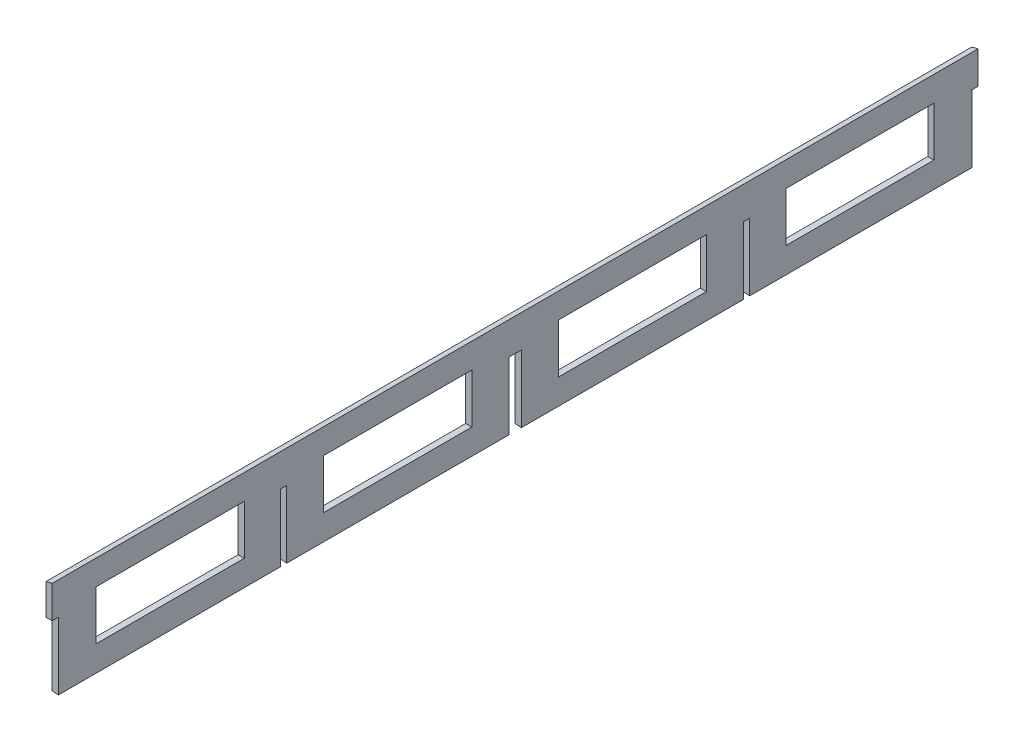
ISO-10303-21;
HEADER;
FILE_DESCRIPTION(('STEP AP214'),'2;1');
FILE_NAME('part.step','',(''),(''),'','','');
FILE_SCHEMA(('AUTOMOTIVE_DESIGN { 1 0 10303 214 1 1 1 1 }'));
ENDSEC;
DATA;
#1=APPLICATION_CONTEXT('core data for automotive mechanical design processes');
#2=APPLICATION_PROTOCOL_DEFINITION('international standard','automotive_design',2000,#1);
#3=PRODUCT_CONTEXT('',#1,'mechanical');
#4=PRODUCT('Part','Part','',(#3));
#5=PRODUCT_RELATED_PRODUCT_CATEGORY('part','',(#4));
#6=PRODUCT_DEFINITION_FORMATION('','',#4);
#7=PRODUCT_DEFINITION_CONTEXT('part definition',#1,'design');
#8=PRODUCT_DEFINITION('design','',#6,#7);
#9=PRODUCT_DEFINITION_SHAPE('','',#8);
#10=(LENGTH_UNIT() NAMED_UNIT(*) SI_UNIT(.MILLI.,.METRE.));
#11=(NAMED_UNIT(*) PLANE_ANGLE_UNIT() SI_UNIT($,.RADIAN.));
#12=(NAMED_UNIT(*) SI_UNIT($,.STERADIAN.) SOLID_ANGLE_UNIT());
#13=UNCERTAINTY_MEASURE_WITH_UNIT(LENGTH_MEASURE(1.E-05),#10,'distance_accuracy_value','');
#14=(GEOMETRIC_REPRESENTATION_CONTEXT(3) GLOBAL_UNCERTAINTY_ASSIGNED_CONTEXT((#13)) GLOBAL_UNIT_ASSIGNED_CONTEXT((#10,
#11,#12)) REPRESENTATION_CONTEXT('',''));
#15=CARTESIAN_POINT('',(0.,0.,0.));
#16=DIRECTION('',(0.,0.,1.));
#17=DIRECTION('',(1.,0.,0.));
#18=AXIS2_PLACEMENT_3D('',#15,#16,#17);
#19=CARTESIAN_POINT('',(54.4195,0.,473.075));
#20=DIRECTION('',(-1.,0.,0.));
#21=DIRECTION('',(0.,0.,1.));
#22=AXIS2_PLACEMENT_3D('',#19,#20,#21);
#23=PLANE('',#22);
#24=DIRECTION('',(0.,0.,1.));
#25=VECTOR('',#24,1.);
#26=CARTESIAN_POINT('',(54.4195,-7.67150251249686,0.));
#27=LINE('',#26,#25);
#28=CARTESIAN_POINT('',(54.4195,-7.67150251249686,22.6342500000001));
#29=VERTEX_POINT('',#28);
#30=CARTESIAN_POINT('',(54.4195,-7.67150251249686,98.8342500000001));
#31=VERTEX_POINT('',#30);
#32=EDGE_CURVE('E69',#29,#31,#27,.T.);
#33=ORIENTED_EDGE('',*,*,#32,.F.);
#34=DIRECTION('',(0.,1.,0.));
#35=VECTOR('',#34,1.);
#36=CARTESIAN_POINT('',(54.4195,0.,22.6342500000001));
#37=LINE('',#36,#35);
#38=CARTESIAN_POINT('',(54.4195,17.7284974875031,22.6342500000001));
#39=VERTEX_POINT('',#38);
#40=EDGE_CURVE('E336',#29,#39,#37,.T.);
#41=ORIENTED_EDGE('',*,*,#40,.T.);
#42=DIRECTION('',(0.,0.,1.));
#43=VECTOR('',#42,1.);
#44=CARTESIAN_POINT('',(54.4195,17.7284974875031,0.));
#45=LINE('',#44,#43);
#46=CARTESIAN_POINT('',(54.4195,17.7284974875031,98.8342500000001));
#47=VERTEX_POINT('',#46);
#48=EDGE_CURVE('E318',#39,#47,#45,.T.);
#49=ORIENTED_EDGE('',*,*,#48,.T.);
#50=DIRECTION('',(0.,1.,0.));
#51=VECTOR('',#50,1.);
#52=CARTESIAN_POINT('',(54.4195,0.,98.8342500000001));
#53=LINE('',#52,#51);
#54=EDGE_CURVE('E329',#31,#47,#53,.T.);
#55=ORIENTED_EDGE('',*,*,#54,.F.);
#56=EDGE_LOOP('',(#33,#41,#49,#55));
#57=FACE_BOUND('',#56,.T.);
#58=DIRECTION('',(0.,0.,1.));
#59=VECTOR('',#58,1.);
#60=CARTESIAN_POINT('',(54.4195,-20.4997657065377,-42.1647085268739));
#61=LINE('',#60,#59);
#62=CARTESIAN_POINT('',(54.4194999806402,-20.4997657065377,4.81200000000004));
#63=VERTEX_POINT('',#62);
#64=CARTESIAN_POINT('',(54.4194999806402,-20.4997657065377,117.475));
#65=VERTEX_POINT('',#64);
#66=EDGE_CURVE('E739',#63,#65,#61,.T.);
#67=ORIENTED_EDGE('',*,*,#66,.T.);
#68=DIRECTION('',(5.63454938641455E-10,1.,0.));
#69=VECTOR('',#68,1.);
#70=CARTESIAN_POINT('',(54.4194999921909,-3.06629360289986E-08,117.475));
#71=LINE('',#70,#69);
#72=CARTESIAN_POINT('',(54.4195,13.8593727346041,117.475));
#73=VERTEX_POINT('',#72);
#74=EDGE_CURVE('E444',#65,#73,#71,.T.);
#75=ORIENTED_EDGE('',*,*,#74,.T.);
#76=DIRECTION('',(0.,0.,1.));
#77=VECTOR('',#76,1.);
#78=CARTESIAN_POINT('',(54.4195,13.8593727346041,117.475));
#79=LINE('',#78,#77);
#80=CARTESIAN_POINT('',(54.4195,13.8593727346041,120.65));
#81=VERTEX_POINT('',#80);
#82=EDGE_CURVE('E458',#73,#81,#79,.T.);
#83=ORIENTED_EDGE('',*,*,#82,.T.);
#84=DIRECTION('',(5.63454938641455E-10,1.,0.));
#85=VECTOR('',#84,1.);
#86=CARTESIAN_POINT('',(54.4194999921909,-3.06629360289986E-08,120.65));
#87=LINE('',#86,#85);
#88=CARTESIAN_POINT('',(54.4194999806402,-20.4997657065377,120.65));
#89=VERTEX_POINT('',#88);
#90=EDGE_CURVE('E440',#89,#81,#87,.T.);
#91=ORIENTED_EDGE('',*,*,#90,.F.);
#92=CARTESIAN_POINT('',(54.4194999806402,-20.4997657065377,156.958));
#93=VERTEX_POINT('',#92);
#94=EDGE_CURVE('E742',#89,#93,#61,.T.);
#95=ORIENTED_EDGE('',*,*,#94,.T.);
#96=DIRECTION('',(0.,0.,1.));
#97=VECTOR('',#96,1.);
#98=CARTESIAN_POINT('',(54.4194999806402,-20.4997657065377,-0.0499999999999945));
#99=LINE('',#98,#97);
#100=CARTESIAN_POINT('',(54.4194999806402,-20.4997657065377,161.958000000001));
#101=VERTEX_POINT('',#100);
#102=EDGE_CURVE('E653',#93,#101,#99,.T.);
#103=ORIENTED_EDGE('',*,*,#102,.T.);
#104=DIRECTION('',(0.,0.,1.));
#105=VECTOR('',#104,1.);
#106=CARTESIAN_POINT('',(54.4195,-20.4997657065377,142.974));
#107=LINE('',#106,#105);
#108=CARTESIAN_POINT('',(54.4194999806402,-20.4997657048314,234.95));
#109=VERTEX_POINT('',#108);
#110=EDGE_CURVE('E746',#101,#109,#107,.T.);
#111=ORIENTED_EDGE('',*,*,#110,.T.);
#112=DIRECTION('',(-5.63454938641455E-10,-1.,0.));
#113=VECTOR('',#112,1.);
#114=CARTESIAN_POINT('',(54.4194999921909,-3.06629360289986E-08,234.95));
#115=LINE('',#114,#113);
#116=CARTESIAN_POINT('',(54.4195,13.8593727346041,234.95));
#117=VERTEX_POINT('',#116);
#118=EDGE_CURVE('E465',#117,#109,#115,.T.);
#119=ORIENTED_EDGE('',*,*,#118,.F.);
#120=DIRECTION('',(0.,0.,1.));
#121=VECTOR('',#120,1.);
#122=CARTESIAN_POINT('',(54.4195,13.8593727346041,234.95));
#123=LINE('',#122,#121);
#124=CARTESIAN_POINT('',(54.4195,13.8593727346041,241.3));
#125=VERTEX_POINT('',#124);
#126=EDGE_CURVE('E504',#117,#125,#123,.T.);
#127=ORIENTED_EDGE('',*,*,#126,.T.);
#128=DIRECTION('',(-5.63454938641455E-10,-1.,0.));
#129=VECTOR('',#128,1.);
#130=CARTESIAN_POINT('',(54.4194999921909,-3.06629360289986E-08,241.3));
#131=LINE('',#130,#129);
#132=CARTESIAN_POINT('',(54.4194999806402,-20.4997657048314,241.3));
#133=VERTEX_POINT('',#132);
#134=EDGE_CURVE('E462',#125,#133,#131,.T.);
#135=ORIENTED_EDGE('',*,*,#134,.T.);
#136=CARTESIAN_POINT('',(54.4194999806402,-20.4997657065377,314.104));
#137=VERTEX_POINT('',#136);
#138=EDGE_CURVE('E690',#133,#137,#107,.T.);
#139=ORIENTED_EDGE('',*,*,#138,.T.);
#140=DIRECTION('',(0.,0.,1.));
#141=VECTOR('',#140,1.);
#142=CARTESIAN_POINT('',(54.4194999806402,-20.4997657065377,300.12));
#143=LINE('',#142,#141);
#144=CARTESIAN_POINT('',(54.4194999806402,-20.4997657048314,355.6));
#145=VERTEX_POINT('',#144);
#146=EDGE_CURVE('E675',#137,#145,#143,.T.);
#147=ORIENTED_EDGE('',*,*,#146,.T.);
#148=DIRECTION('',(5.63454938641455E-10,1.,0.));
#149=VECTOR('',#148,1.);
#150=CARTESIAN_POINT('',(54.4194999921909,-3.06629360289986E-08,355.6));
#151=LINE('',#150,#149);
#152=CARTESIAN_POINT('',(54.4195,13.8593727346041,355.6));
#153=VERTEX_POINT('',#152);
#154=EDGE_CURVE('E519',#145,#153,#151,.T.);
#155=ORIENTED_EDGE('',*,*,#154,.T.);
#156=DIRECTION('',(0.,0.,1.));
#157=VECTOR('',#156,1.);
#158=CARTESIAN_POINT('',(54.4195,13.8593727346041,355.6));
#159=LINE('',#158,#157);
#160=CARTESIAN_POINT('',(54.4195,13.8593727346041,358.775));
#161=VERTEX_POINT('',#160);
#162=EDGE_CURVE('E533',#153,#161,#159,.T.);
#163=ORIENTED_EDGE('',*,*,#162,.T.);
#164=DIRECTION('',(5.63454938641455E-10,1.,0.));
#165=VECTOR('',#164,1.);
#166=CARTESIAN_POINT('',(54.4194999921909,-3.06629360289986E-08,358.775));
#167=LINE('',#166,#165);
#168=CARTESIAN_POINT('',(54.4194999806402,-20.4997657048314,358.775));
#169=VERTEX_POINT('',#168);
#170=EDGE_CURVE('E515',#169,#161,#167,.T.);
#171=ORIENTED_EDGE('',*,*,#170,.F.);
#172=CARTESIAN_POINT('',(54.4194999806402,-20.4997657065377,473.075));
#173=VERTEX_POINT('',#172);
#174=EDGE_CURVE('E697',#169,#173,#143,.T.);
#175=ORIENTED_EDGE('',*,*,#174,.T.);
#176=DIRECTION('',(0.,-1.,0.));
#177=VECTOR('',#176,1.);
#178=CARTESIAN_POINT('',(54.4195,0.,473.075));
#179=LINE('',#178,#177);
#180=CARTESIAN_POINT('',(54.4195,13.8593727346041,473.075));
#181=VERTEX_POINT('',#180);
#182=EDGE_CURVE('E674',#181,#173,#179,.T.);
#183=ORIENTED_EDGE('',*,*,#182,.F.);
#184=DIRECTION('',(0.,0.,1.));
#185=VECTOR('',#184,1.);
#186=CARTESIAN_POINT('',(54.4195,13.8593727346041,473.075));
#187=LINE('',#186,#185);
#188=CARTESIAN_POINT('',(54.4195,13.8593727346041,476.25));
#189=VERTEX_POINT('',#188);
#190=EDGE_CURVE('E687',#181,#189,#187,.T.);
#191=ORIENTED_EDGE('',*,*,#190,.T.);
#192=DIRECTION('',(0.,-1.,0.));
#193=VECTOR('',#192,1.);
#194=CARTESIAN_POINT('',(54.4195,0.,476.25));
#195=LINE('',#194,#193);
#196=CARTESIAN_POINT('',(54.4194999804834,29.8052641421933,476.25));
#197=VERTEX_POINT('',#196);
#198=EDGE_CURVE('E626',#197,#189,#195,.T.);
#199=ORIENTED_EDGE('',*,*,#198,.F.);
#200=DIRECTION('',(0.,0.,-1.));
#201=VECTOR('',#200,1.);
#202=CARTESIAN_POINT('',(54.4195,29.8052641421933,3.175));
#203=LINE('',#202,#201);
#204=CARTESIAN_POINT('',(54.4195,29.8052641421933,0.));
#205=VERTEX_POINT('',#204);
#206=EDGE_CURVE('E999',#197,#205,#203,.T.);
#207=ORIENTED_EDGE('',*,*,#206,.T.);
#208=DIRECTION('',(0.,1.,0.));
#209=VECTOR('',#208,1.);
#210=CARTESIAN_POINT('',(54.4195,7.78722275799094,0.));
#211=LINE('',#210,#209);
#212=CARTESIAN_POINT('',(54.4195,13.8593727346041,0.));
#213=VERTEX_POINT('',#212);
#214=EDGE_CURVE('E669',#213,#205,#211,.T.);
#215=ORIENTED_EDGE('',*,*,#214,.F.);
#216=DIRECTION('',(0.,0.,-1.));
#217=VECTOR('',#216,1.);
#218=CARTESIAN_POINT('',(54.4195,13.8593727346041,3.175));
#219=LINE('',#218,#217);
#220=CARTESIAN_POINT('',(54.4195,13.8593727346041,3.175));
#221=VERTEX_POINT('',#220);
#222=EDGE_CURVE('E661',#221,#213,#219,.T.);
#223=ORIENTED_EDGE('',*,*,#222,.F.);
#224=DIRECTION('',(0.,1.,0.));
#225=VECTOR('',#224,1.);
#226=CARTESIAN_POINT('',(54.4195,25.3981079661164,3.175));
#227=LINE('',#226,#225);
#228=CARTESIAN_POINT('',(54.4195000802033,-20.4996050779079,3.17500000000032));
#229=VERTEX_POINT('',#228);
#230=EDGE_CURVE('E549',#229,#221,#227,.T.);
#231=ORIENTED_EDGE('',*,*,#230,.F.);
#232=EDGE_CURVE('E546',#229,#63,#99,.T.);
#233=ORIENTED_EDGE('',*,*,#232,.T.);
#234=EDGE_LOOP('',(#67,#75,#83,#91,#95,#103,#111,#119,#127,#135,#139,#147,#155,#163,#171,#175,
#183,#191,#199,#207,#215,#223,#231,#233));
#235=FACE_BOUND('',#234,.T.);
#236=DIRECTION('',(0.,1.,0.));
#237=VECTOR('',#236,1.);
#238=CARTESIAN_POINT('',(54.4195,0.,453.61575));
#239=LINE('',#238,#237);
#240=CARTESIAN_POINT('',(54.4195,-7.67150251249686,453.61575));
#241=VERTEX_POINT('',#240);
#242=CARTESIAN_POINT('',(54.4195,17.7284974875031,453.61575));
#243=VERTEX_POINT('',#242);
#244=EDGE_CURVE('E412',#241,#243,#239,.T.);
#245=ORIENTED_EDGE('',*,*,#244,.F.);
#246=DIRECTION('',(0.,0.,-1.));
#247=VECTOR('',#246,1.);
#248=CARTESIAN_POINT('',(54.4195,-7.67150251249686,0.));
#249=LINE('',#248,#247);
#250=CARTESIAN_POINT('',(54.4195,-7.67150251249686,377.41575));
#251=VERTEX_POINT('',#250);
#252=EDGE_CURVE('E408',#241,#251,#249,.T.);
#253=ORIENTED_EDGE('',*,*,#252,.T.);
#254=DIRECTION('',(0.,1.,0.));
#255=VECTOR('',#254,1.);
#256=CARTESIAN_POINT('',(54.4195,0.,377.41575));
#257=LINE('',#256,#255);
#258=CARTESIAN_POINT('',(54.4195,17.7284974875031,377.41575));
#259=VERTEX_POINT('',#258);
#260=EDGE_CURVE('E420',#251,#259,#257,.T.);
#261=ORIENTED_EDGE('',*,*,#260,.T.);
#262=DIRECTION('',(0.,0.,-1.));
#263=VECTOR('',#262,1.);
#264=CARTESIAN_POINT('',(54.4195,17.7284974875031,0.));
#265=LINE('',#264,#263);
#266=EDGE_CURVE('E416',#243,#259,#265,.T.);
#267=ORIENTED_EDGE('',*,*,#266,.F.);
#268=EDGE_LOOP('',(#245,#253,#261,#267));
#269=FACE_BOUND('',#268,.T.);
#270=DIRECTION('',(0.,0.,1.));
#271=VECTOR('',#270,1.);
#272=CARTESIAN_POINT('',(54.4195,-7.73918291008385,0.));
#273=LINE('',#272,#271);
#274=CARTESIAN_POINT('',(54.4195,-7.73918291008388,260.35));
#275=VERTEX_POINT('',#274);
#276=CARTESIAN_POINT('',(54.4195,-7.73918291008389,336.55));
#277=VERTEX_POINT('',#276);
#278=EDGE_CURVE('E383',#275,#277,#273,.T.);
#279=ORIENTED_EDGE('',*,*,#278,.F.);
#280=DIRECTION('',(0.,1.,0.));
#281=VECTOR('',#280,1.);
#282=CARTESIAN_POINT('',(54.4195,0.,260.35));
#283=LINE('',#282,#281);
#284=CARTESIAN_POINT('',(54.4195,17.6608170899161,260.35));
#285=VERTEX_POINT('',#284);
#286=EDGE_CURVE('E379',#275,#285,#283,.T.);
#287=ORIENTED_EDGE('',*,*,#286,.T.);
#288=DIRECTION('',(0.,0.,1.));
#289=VECTOR('',#288,1.);
#290=CARTESIAN_POINT('',(54.4195,17.6608170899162,0.));
#291=LINE('',#290,#289);
#292=CARTESIAN_POINT('',(54.4195,17.6608170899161,336.55));
#293=VERTEX_POINT('',#292);
#294=EDGE_CURVE('E392',#285,#293,#291,.T.);
#295=ORIENTED_EDGE('',*,*,#294,.T.);
#296=DIRECTION('',(0.,1.,0.));
#297=VECTOR('',#296,1.);
#298=CARTESIAN_POINT('',(54.4195,0.,336.55));
#299=LINE('',#298,#297);
#300=EDGE_CURVE('E388',#277,#293,#299,.T.);
#301=ORIENTED_EDGE('',*,*,#300,.F.);
#302=EDGE_LOOP('',(#279,#287,#295,#301));
#303=FACE_BOUND('',#302,.T.);
#304=DIRECTION('',(0.,0.,-1.));
#305=VECTOR('',#304,1.);
#306=CARTESIAN_POINT('',(54.4195,-7.73918291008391,0.));
#307=LINE('',#306,#305);
#308=CARTESIAN_POINT('',(54.4195,-7.73918291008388,215.9));
#309=VERTEX_POINT('',#308);
#310=CARTESIAN_POINT('',(54.4195,-7.73918291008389,139.7));
#311=VERTEX_POINT('',#310);
#312=EDGE_CURVE('E354',#309,#311,#307,.T.);
#313=ORIENTED_EDGE('',*,*,#312,.T.);
#314=DIRECTION('',(0.,1.,0.));
#315=VECTOR('',#314,1.);
#316=CARTESIAN_POINT('',(54.4195,0.,139.7));
#317=LINE('',#316,#315);
#318=CARTESIAN_POINT('',(54.4195,17.6608170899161,139.7));
#319=VERTEX_POINT('',#318);
#320=EDGE_CURVE('E77',#311,#319,#317,.T.);
#321=ORIENTED_EDGE('',*,*,#320,.T.);
#322=DIRECTION('',(0.,0.,-1.));
#323=VECTOR('',#322,1.);
#324=CARTESIAN_POINT('',(54.4195,17.6608170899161,0.));
#325=LINE('',#324,#323);
#326=CARTESIAN_POINT('',(54.4195,17.6608170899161,215.9));
#327=VERTEX_POINT('',#326);
#328=EDGE_CURVE('E363',#327,#319,#325,.T.);
#329=ORIENTED_EDGE('',*,*,#328,.F.);
#330=DIRECTION('',(0.,1.,0.));
#331=VECTOR('',#330,1.);
#332=CARTESIAN_POINT('',(54.4195,0.,215.9));
#333=LINE('',#332,#331);
#334=EDGE_CURVE('E359',#309,#327,#333,.T.);
#335=ORIENTED_EDGE('',*,*,#334,.F.);
#336=EDGE_LOOP('',(#313,#321,#329,#335));
#337=FACE_BOUND('',#336,.T.);
#338=ADVANCED_FACE('F53',(#57,#235,#269,#303,#337),#23,.T.);
#339=CARTESIAN_POINT('',(57.5945,7.78722275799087,3.175));
#340=DIRECTION('',(-1.,0.,0.));
#341=DIRECTION('',(0.,-1.,0.));
#342=AXIS2_PLACEMENT_3D('',#339,#340,#341);
#343=PLANE('',#342);
#344=DIRECTION('',(0.,1.,0.));
#345=VECTOR('',#344,1.);
#346=CARTESIAN_POINT('',(57.5945,7.78722275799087,22.6342500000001));
#347=LINE('',#346,#345);
#348=CARTESIAN_POINT('',(57.5945,-7.67150251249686,22.6342500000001));
#349=VERTEX_POINT('',#348);
#350=CARTESIAN_POINT('',(57.5945,17.7284974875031,22.6342500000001));
#351=VERTEX_POINT('',#350);
#352=EDGE_CURVE('E62',#349,#351,#347,.T.);
#353=ORIENTED_EDGE('',*,*,#352,.F.);
#354=DIRECTION('',(0.,0.,1.));
#355=VECTOR('',#354,1.);
#356=CARTESIAN_POINT('',(57.5945,-7.67150251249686,3.175));
#357=LINE('',#356,#355);
#358=CARTESIAN_POINT('',(57.5945,-7.67150251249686,98.8342500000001));
#359=VERTEX_POINT('',#358);
#360=EDGE_CURVE('E11',#349,#359,#357,.T.);
#361=ORIENTED_EDGE('',*,*,#360,.T.);
#362=DIRECTION('',(0.,1.,0.));
#363=VECTOR('',#362,1.);
#364=CARTESIAN_POINT('',(57.5945,7.78722275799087,98.8342500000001));
#365=LINE('',#364,#363);
#366=CARTESIAN_POINT('',(57.5945,17.7284974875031,98.8342500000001));
#367=VERTEX_POINT('',#366);
#368=EDGE_CURVE('E808',#359,#367,#365,.T.);
#369=ORIENTED_EDGE('',*,*,#368,.T.);
#370=DIRECTION('',(0.,0.,1.));
#371=VECTOR('',#370,1.);
#372=CARTESIAN_POINT('',(57.5945,17.7284974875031,3.175));
#373=LINE('',#372,#371);
#374=EDGE_CURVE('E321',#351,#367,#373,.T.);
#375=ORIENTED_EDGE('',*,*,#374,.F.);
#376=EDGE_LOOP('',(#353,#361,#369,#375));
#377=FACE_BOUND('',#376,.T.);
#378=DIRECTION('',(0.,1.,0.));
#379=VECTOR('',#378,1.);
#380=CARTESIAN_POINT('',(57.5945,7.78722275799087,260.35));
#381=LINE('',#380,#379);
#382=CARTESIAN_POINT('',(57.5945,-7.73918291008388,260.35));
#383=VERTEX_POINT('',#382);
#384=CARTESIAN_POINT('',(57.5945,17.6608170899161,260.35));
#385=VERTEX_POINT('',#384);
#386=EDGE_CURVE('E791',#383,#385,#381,.T.);
#387=ORIENTED_EDGE('',*,*,#386,.F.);
#388=DIRECTION('',(0.,0.,1.));
#389=VECTOR('',#388,1.);
#390=CARTESIAN_POINT('',(57.5945,-7.73918291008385,3.175));
#391=LINE('',#390,#389);
#392=CARTESIAN_POINT('',(57.5945,-7.73918291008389,336.55));
#393=VERTEX_POINT('',#392);
#394=EDGE_CURVE('E780',#383,#393,#391,.T.);
#395=ORIENTED_EDGE('',*,*,#394,.T.);
#396=DIRECTION('',(0.,1.,0.));
#397=VECTOR('',#396,1.);
#398=CARTESIAN_POINT('',(57.5945,7.78722275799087,336.55));
#399=LINE('',#398,#397);
#400=CARTESIAN_POINT('',(57.5945,17.6608170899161,336.55));
#401=VERTEX_POINT('',#400);
#402=EDGE_CURVE('E784',#393,#401,#399,.T.);
#403=ORIENTED_EDGE('',*,*,#402,.T.);
#404=DIRECTION('',(0.,0.,1.));
#405=VECTOR('',#404,1.);
#406=CARTESIAN_POINT('',(57.5945,17.6608170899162,3.175));
#407=LINE('',#406,#405);
#408=EDGE_CURVE('E788',#385,#401,#407,.T.);
#409=ORIENTED_EDGE('',*,*,#408,.F.);
#410=EDGE_LOOP('',(#387,#395,#403,#409));
#411=FACE_BOUND('',#410,.T.);
#412=DIRECTION('',(0.,1.,0.));
#413=VECTOR('',#412,1.);
#414=CARTESIAN_POINT('',(57.5944999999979,5.52181219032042E-12,117.475));
#415=LINE('',#414,#413);
#416=CARTESIAN_POINT('',(57.5944999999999,-20.7704069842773,117.475));
#417=VERTEX_POINT('',#416);
#418=CARTESIAN_POINT('',(57.5945,13.8593727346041,117.475));
#419=VERTEX_POINT('',#418);
#420=EDGE_CURVE('E436',#417,#419,#415,.T.);
#421=ORIENTED_EDGE('',*,*,#420,.F.);
#422=DIRECTION('',(0.,0.,1.));
#423=VECTOR('',#422,1.);
#424=CARTESIAN_POINT('',(57.5944999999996,-20.7704069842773,-42.164708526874));
#425=LINE('',#424,#423);
#426=CARTESIAN_POINT('',(57.5944999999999,-20.7704069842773,4.81200000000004));
#427=VERTEX_POINT('',#426);
#428=EDGE_CURVE('E1001',#427,#417,#425,.T.);
#429=ORIENTED_EDGE('',*,*,#428,.F.);
#430=DIRECTION('',(0.,0.,1.));
#431=VECTOR('',#430,1.);
#432=CARTESIAN_POINT('',(57.5944999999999,-20.7704069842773,-0.0499999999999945));
#433=LINE('',#432,#431);
#434=CARTESIAN_POINT('',(57.594498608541,-20.7703898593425,3.17500000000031));
#435=VERTEX_POINT('',#434);
#436=EDGE_CURVE('E637',#435,#427,#433,.T.);
#437=ORIENTED_EDGE('',*,*,#436,.F.);
#438=DIRECTION('',(0.,1.,0.));
#439=VECTOR('',#438,1.);
#440=CARTESIAN_POINT('',(57.5945,25.3981079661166,3.175));
#441=LINE('',#440,#439);
#442=CARTESIAN_POINT('',(57.5945,13.8593727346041,3.175));
#443=VERTEX_POINT('',#442);
#444=EDGE_CURVE('E542',#435,#443,#441,.T.);
#445=ORIENTED_EDGE('',*,*,#444,.T.);
#446=DIRECTION('',(0.,0.,-1.));
#447=VECTOR('',#446,1.);
#448=CARTESIAN_POINT('',(57.5945,13.8593727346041,3.175));
#449=LINE('',#448,#447);
#450=CARTESIAN_POINT('',(57.5945,13.8593727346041,0.));
#451=VERTEX_POINT('',#450);
#452=EDGE_CURVE('E662',#443,#451,#449,.T.);
#453=ORIENTED_EDGE('',*,*,#452,.T.);
#454=DIRECTION('',(0.,1.,0.));
#455=VECTOR('',#454,1.);
#456=CARTESIAN_POINT('',(57.5945,7.78722275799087,0.));
#457=LINE('',#456,#455);
#458=CARTESIAN_POINT('',(57.5945,30.5567205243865,0.));
#459=VERTEX_POINT('',#458);
#460=EDGE_CURVE('E666',#451,#459,#457,.T.);
#461=ORIENTED_EDGE('',*,*,#460,.T.);
#462=DIRECTION('',(0.,0.,1.));
#463=VECTOR('',#462,1.);
#464=CARTESIAN_POINT('',(57.5945,30.5567205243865,-22.9307442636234));
#465=LINE('',#464,#463);
#466=CARTESIAN_POINT('',(57.5945,30.5567205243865,476.25));
#467=VERTEX_POINT('',#466);
#468=EDGE_CURVE('E665',#459,#467,#465,.T.);
#469=ORIENTED_EDGE('',*,*,#468,.T.);
#470=DIRECTION('',(0.,-1.,0.));
#471=VECTOR('',#470,1.);
#472=CARTESIAN_POINT('',(57.5945,0.,476.25));
#473=LINE('',#472,#471);
#474=CARTESIAN_POINT('',(57.5945,13.8593727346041,476.25));
#475=VERTEX_POINT('',#474);
#476=EDGE_CURVE('E648',#467,#475,#473,.T.);
#477=ORIENTED_EDGE('',*,*,#476,.T.);
#478=DIRECTION('',(0.,0.,1.));
#479=VECTOR('',#478,1.);
#480=CARTESIAN_POINT('',(57.5945,13.8593727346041,473.075));
#481=LINE('',#480,#479);
#482=CARTESIAN_POINT('',(57.5945,13.8593727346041,473.075));
#483=VERTEX_POINT('',#482);
#484=EDGE_CURVE('E553',#483,#475,#481,.T.);
#485=ORIENTED_EDGE('',*,*,#484,.F.);
#486=DIRECTION('',(0.,-1.,0.));
#487=VECTOR('',#486,1.);
#488=CARTESIAN_POINT('',(57.5945,0.,473.075));
#489=LINE('',#488,#487);
#490=CARTESIAN_POINT('',(57.5944999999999,-20.7704069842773,473.075));
#491=VERTEX_POINT('',#490);
#492=EDGE_CURVE('E545',#483,#491,#489,.T.);
#493=ORIENTED_EDGE('',*,*,#492,.T.);
#494=CARTESIAN_POINT('',(57.5944999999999,-20.7704069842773,358.775));
#495=VERTEX_POINT('',#494);
#496=EDGE_CURVE('E649',#495,#491,#433,.T.);
#497=ORIENTED_EDGE('',*,*,#496,.F.);
#498=DIRECTION('',(0.,1.,0.));
#499=VECTOR('',#498,1.);
#500=CARTESIAN_POINT('',(57.5944999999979,5.52181219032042E-12,358.775));
#501=LINE('',#500,#499);
#502=CARTESIAN_POINT('',(57.5945,13.8593727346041,358.775));
#503=VERTEX_POINT('',#502);
#504=EDGE_CURVE('E508',#495,#503,#501,.T.);
#505=ORIENTED_EDGE('',*,*,#504,.T.);
#506=DIRECTION('',(0.,0.,1.));
#507=VECTOR('',#506,1.);
#508=CARTESIAN_POINT('',(57.5945,13.8593727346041,355.6));
#509=LINE('',#508,#507);
#510=CARTESIAN_POINT('',(57.5945,13.8593727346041,355.6));
#511=VERTEX_POINT('',#510);
#512=EDGE_CURVE('E523',#511,#503,#509,.T.);
#513=ORIENTED_EDGE('',*,*,#512,.F.);
#514=DIRECTION('',(0.,1.,0.));
#515=VECTOR('',#514,1.);
#516=CARTESIAN_POINT('',(57.5944999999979,5.52181219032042E-12,355.6));
#517=LINE('',#516,#515);
#518=CARTESIAN_POINT('',(57.5944999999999,-20.7704069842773,355.6));
#519=VERTEX_POINT('',#518);
#520=EDGE_CURVE('E511',#519,#511,#517,.T.);
#521=ORIENTED_EDGE('',*,*,#520,.F.);
#522=CARTESIAN_POINT('',(57.5944999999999,-20.7704069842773,314.104));
#523=VERTEX_POINT('',#522);
#524=EDGE_CURVE('E644',#523,#519,#433,.T.);
#525=ORIENTED_EDGE('',*,*,#524,.F.);
#526=DIRECTION('',(0.,0.,1.));
#527=VECTOR('',#526,1.);
#528=CARTESIAN_POINT('',(57.5944999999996,-20.7704069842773,142.974));
#529=LINE('',#528,#527);
#530=CARTESIAN_POINT('',(57.5944999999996,-20.7704069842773,241.3));
#531=VERTEX_POINT('',#530);
#532=EDGE_CURVE('E1042',#531,#523,#529,.T.);
#533=ORIENTED_EDGE('',*,*,#532,.F.);
#534=DIRECTION('',(0.,1.,0.));
#535=VECTOR('',#534,1.);
#536=CARTESIAN_POINT('',(57.5944999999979,5.52181219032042E-12,241.3));
#537=LINE('',#536,#535);
#538=CARTESIAN_POINT('',(57.5945,13.8593727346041,241.3));
#539=VERTEX_POINT('',#538);
#540=EDGE_CURVE('E494',#531,#539,#537,.T.);
#541=ORIENTED_EDGE('',*,*,#540,.T.);
#542=DIRECTION('',(0.,0.,1.));
#543=VECTOR('',#542,1.);
#544=CARTESIAN_POINT('',(57.5945,13.8593727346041,234.95));
#545=LINE('',#544,#543);
#546=CARTESIAN_POINT('',(57.5945,13.8593727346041,234.95));
#547=VERTEX_POINT('',#546);
#548=EDGE_CURVE('E484',#547,#539,#545,.T.);
#549=ORIENTED_EDGE('',*,*,#548,.F.);
#550=DIRECTION('',(0.,1.,0.));
#551=VECTOR('',#550,1.);
#552=CARTESIAN_POINT('',(57.5944999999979,5.52181219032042E-12,234.95));
#553=LINE('',#552,#551);
#554=CARTESIAN_POINT('',(57.5944999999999,-20.7704069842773,234.95));
#555=VERTEX_POINT('',#554);
#556=EDGE_CURVE('E474',#555,#547,#553,.T.);
#557=ORIENTED_EDGE('',*,*,#556,.F.);
#558=CARTESIAN_POINT('',(57.5944999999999,-20.7704069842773,161.958));
#559=VERTEX_POINT('',#558);
#560=EDGE_CURVE('E686',#559,#555,#529,.T.);
#561=ORIENTED_EDGE('',*,*,#560,.F.);
#562=CARTESIAN_POINT('',(57.5944999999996,-20.7704069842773,156.958));
#563=VERTEX_POINT('',#562);
#564=EDGE_CURVE('E642',#563,#559,#433,.T.);
#565=ORIENTED_EDGE('',*,*,#564,.F.);
#566=CARTESIAN_POINT('',(57.5944999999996,-20.7704069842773,120.65));
#567=VERTEX_POINT('',#566);
#568=EDGE_CURVE('E537',#567,#563,#425,.T.);
#569=ORIENTED_EDGE('',*,*,#568,.F.);
#570=DIRECTION('',(0.,1.,0.));
#571=VECTOR('',#570,1.);
#572=CARTESIAN_POINT('',(57.5944999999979,5.52181219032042E-12,120.65));
#573=LINE('',#572,#571);
#574=CARTESIAN_POINT('',(57.5945,13.8593727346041,120.65));
#575=VERTEX_POINT('',#574);
#576=EDGE_CURVE('E347',#567,#575,#573,.T.);
#577=ORIENTED_EDGE('',*,*,#576,.T.);
#578=DIRECTION('',(0.,0.,1.));
#579=VECTOR('',#578,1.);
#580=CARTESIAN_POINT('',(57.5945,13.8593727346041,117.475));
#581=LINE('',#580,#579);
#582=EDGE_CURVE('E448',#419,#575,#581,.T.);
#583=ORIENTED_EDGE('',*,*,#582,.F.);
#584=EDGE_LOOP('',(#421,#429,#437,#445,#453,#461,#469,#477,#485,#493,#497,#505,#513,#521,#525,
#533,#541,#549,#557,#561,#565,#569,#577,#583));
#585=FACE_BOUND('',#584,.T.);
#586=DIRECTION('',(0.,0.,-1.));
#587=VECTOR('',#586,1.);
#588=CARTESIAN_POINT('',(57.5945,-7.67150251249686,3.175));
#589=LINE('',#588,#587);
#590=CARTESIAN_POINT('',(57.5945,-7.67150251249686,453.61575));
#591=VERTEX_POINT('',#590);
#592=CARTESIAN_POINT('',(57.5945,-7.67150251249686,377.41575));
#593=VERTEX_POINT('',#592);
#594=EDGE_CURVE('E777',#591,#593,#589,.T.);
#595=ORIENTED_EDGE('',*,*,#594,.F.);
#596=DIRECTION('',(0.,1.,0.));
#597=VECTOR('',#596,1.);
#598=CARTESIAN_POINT('',(57.5945,7.78722275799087,453.61575));
#599=LINE('',#598,#597);
#600=CARTESIAN_POINT('',(57.5945,17.7284974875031,453.61575));
#601=VERTEX_POINT('',#600);
#602=EDGE_CURVE('E763',#591,#601,#599,.T.);
#603=ORIENTED_EDGE('',*,*,#602,.T.);
#604=DIRECTION('',(0.,0.,-1.));
#605=VECTOR('',#604,1.);
#606=CARTESIAN_POINT('',(57.5945,17.7284974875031,3.175));
#607=LINE('',#606,#605);
#608=CARTESIAN_POINT('',(57.5945,17.7284974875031,377.41575));
#609=VERTEX_POINT('',#608);
#610=EDGE_CURVE('E770',#601,#609,#607,.T.);
#611=ORIENTED_EDGE('',*,*,#610,.T.);
#612=DIRECTION('',(0.,1.,0.));
#613=VECTOR('',#612,1.);
#614=CARTESIAN_POINT('',(57.5945,7.78722275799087,377.41575));
#615=LINE('',#614,#613);
#616=EDGE_CURVE('E774',#593,#609,#615,.T.);
#617=ORIENTED_EDGE('',*,*,#616,.F.);
#618=EDGE_LOOP('',(#595,#603,#611,#617));
#619=FACE_BOUND('',#618,.T.);
#620=DIRECTION('',(0.,1.,0.));
#621=VECTOR('',#620,1.);
#622=CARTESIAN_POINT('',(57.5945,7.78722275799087,139.7));
#623=LINE('',#622,#621);
#624=CARTESIAN_POINT('',(57.5945,-7.73918291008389,139.7));
#625=VERTEX_POINT('',#624);
#626=CARTESIAN_POINT('',(57.5945,17.6608170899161,139.7));
#627=VERTEX_POINT('',#626);
#628=EDGE_CURVE('E805',#625,#627,#623,.T.);
#629=ORIENTED_EDGE('',*,*,#628,.F.);
#630=DIRECTION('',(0.,0.,-1.));
#631=VECTOR('',#630,1.);
#632=CARTESIAN_POINT('',(57.5945,-7.73918291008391,3.175));
#633=LINE('',#632,#631);
#634=CARTESIAN_POINT('',(57.5945,-7.73918291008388,215.9));
#635=VERTEX_POINT('',#634);
#636=EDGE_CURVE('E794',#635,#625,#633,.T.);
#637=ORIENTED_EDGE('',*,*,#636,.F.);
#638=DIRECTION('',(0.,1.,0.));
#639=VECTOR('',#638,1.);
#640=CARTESIAN_POINT('',(57.5945,7.78722275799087,215.9));
#641=LINE('',#640,#639);
#642=CARTESIAN_POINT('',(57.5945,17.6608170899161,215.9));
#643=VERTEX_POINT('',#642);
#644=EDGE_CURVE('E797',#635,#643,#641,.T.);
#645=ORIENTED_EDGE('',*,*,#644,.T.);
#646=DIRECTION('',(0.,0.,-1.));
#647=VECTOR('',#646,1.);
#648=CARTESIAN_POINT('',(57.5945,17.6608170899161,3.175));
#649=LINE('',#648,#647);
#650=EDGE_CURVE('E801',#643,#627,#649,.T.);
#651=ORIENTED_EDGE('',*,*,#650,.T.);
#652=EDGE_LOOP('',(#629,#637,#645,#651));
#653=FACE_BOUND('',#652,.T.);
#654=ADVANCED_FACE('F601',(#377,#411,#585,#619,#653),#343,.F.);
#655=CARTESIAN_POINT('',(54.4194999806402,-20.4997657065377,-42.1647085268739));
#656=CARTESIAN_POINT('',(54.6049915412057,-20.5161142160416,-42.1647085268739));
#657=CARTESIAN_POINT('',(55.6631296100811,-20.6088145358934,-42.1647085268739));
#658=CARTESIAN_POINT('',(56.7215106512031,-20.6984393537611,-42.1647085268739));
#659=CARTESIAN_POINT('',(57.5944999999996,-20.7704069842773,-42.164708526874));
#660=B_SPLINE_CURVE_WITH_KNOTS('',3,(#655,#656,#657,#658,#659),.UNSPECIFIED.,.F.,.F.,(4,1,4),
(0.,0.175307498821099,1.),.UNSPECIFIED.);
#661=DIRECTION('',(0.,0.,1.));
#662=VECTOR('',#661,1.);
#663=SURFACE_OF_LINEAR_EXTRUSION('',#660,#662);
#664=ORIENTED_EDGE('',*,*,#428,.T.);
#665=CARTESIAN_POINT('',(54.4194999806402,-20.4997657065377,117.475));
#666=CARTESIAN_POINT('',(54.6049915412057,-20.5161142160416,117.475));
#667=CARTESIAN_POINT('',(55.6631296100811,-20.6088145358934,117.475));
#668=CARTESIAN_POINT('',(56.7215106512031,-20.6984393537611,117.475));
#669=CARTESIAN_POINT('',(57.5944999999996,-20.7704069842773,117.475));
#670=B_SPLINE_CURVE_WITH_KNOTS('',3,(#665,#666,#667,#668,#669),.UNSPECIFIED.,.F.,.F.,(4,1,4),
(0.,0.175307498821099,1.),.UNSPECIFIED.);
#671=EDGE_CURVE('E753',#417,#65,#670,.F.);
#672=ORIENTED_EDGE('',*,*,#671,.T.);
#673=ORIENTED_EDGE('',*,*,#66,.F.);
#674=CARTESIAN_POINT('',(533.4,-74.964481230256,4.81200000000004));
#675=CARTESIAN_POINT('',(533.393468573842,-74.3592932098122,4.81200000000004));
#676=CARTESIAN_POINT('',(531.326375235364,-72.9726299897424,4.81200000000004));
#677=CARTESIAN_POINT('',(527.400147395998,-71.2980390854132,4.81200000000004));
#678=CARTESIAN_POINT('',(520.602221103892,-67.7648945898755,4.81200000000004));
#679=CARTESIAN_POINT('',(511.347792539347,-63.3267299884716,4.81200000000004));
#680=CARTESIAN_POINT('',(499.502755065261,-57.6778186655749,4.81200000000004));
#681=CARTESIAN_POINT('',(485.246764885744,-51.1384096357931,4.81200000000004));
#682=CARTESIAN_POINT('',(468.676978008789,-43.8036364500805,4.81200000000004));
#683=CARTESIAN_POINT('',(449.947936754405,-35.8757202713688,4.81200000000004));
#684=CARTESIAN_POINT('',(429.230598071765,-27.5332286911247,4.81200000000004));
#685=CARTESIAN_POINT('',(406.718257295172,-18.9792879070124,4.81200000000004));
#686=CARTESIAN_POINT('',(382.640885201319,-10.382344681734,4.81200000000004));
#687=CARTESIAN_POINT('',(357.234331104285,-1.94698223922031,4.81200000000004));
#688=CARTESIAN_POINT('',(330.760171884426,6.14483374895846,4.81200000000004));
#689=CARTESIAN_POINT('',(303.50010629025,13.7381782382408,4.81200000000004));
#690=CARTESIAN_POINT('',(275.749595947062,20.6681404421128,4.81200000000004));
#691=CARTESIAN_POINT('',(247.797497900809,26.795319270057,4.81200000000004));
#692=CARTESIAN_POINT('',(219.77579834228,32.1343026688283,4.81200000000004));
#693=CARTESIAN_POINT('',(191.912986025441,36.1053653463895,4.81200000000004));
#694=CARTESIAN_POINT('',(164.569256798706,38.4384325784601,4.81200000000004));
#695=CARTESIAN_POINT('',(138.326668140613,39.1929872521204,4.81200000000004));
#696=CARTESIAN_POINT('',(113.549606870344,38.4856846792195,4.81200000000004));
#697=CARTESIAN_POINT('',(90.5807469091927,36.4479003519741,4.81200000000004));
#698=CARTESIAN_POINT('',(69.7330173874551,33.2891377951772,4.81200000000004));
#699=CARTESIAN_POINT('',(51.2766476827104,29.241370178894,4.81200000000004));
#700=CARTESIAN_POINT('',(35.4362610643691,24.539415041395,4.81200000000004));
#701=CARTESIAN_POINT('',(22.3884874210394,19.4234784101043,4.81200000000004));
#702=CARTESIAN_POINT('',(12.2196962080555,14.1253370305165,4.81200000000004));
#703=CARTESIAN_POINT('',(4.99901469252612,8.78084818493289,4.81200000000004));
#704=CARTESIAN_POINT('',(0.528637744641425,3.39704674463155,4.81200000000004));
#705=CARTESIAN_POINT('',(-0.609774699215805,-2.47889500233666,4.81200000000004));
#706=CARTESIAN_POINT('',(2.2546949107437,-7.70032156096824,4.81200000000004));
#707=CARTESIAN_POINT('',(8.00374597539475,-11.5081485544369,4.81200000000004));
#708=CARTESIAN_POINT('',(16.1982900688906,-14.6095937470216,4.81200000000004));
#709=CARTESIAN_POINT('',(26.9584985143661,-17.1149449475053,4.81200000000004));
#710=CARTESIAN_POINT('',(40.1607249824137,-19.119889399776,4.81200000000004));
#711=CARTESIAN_POINT('',(55.6666229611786,-20.6931815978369,4.81200000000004));
#712=CARTESIAN_POINT('',(73.2848054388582,-21.9411220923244,4.81200000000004));
#713=CARTESIAN_POINT('',(92.8177540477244,-22.9728124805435,4.81200000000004));
#714=CARTESIAN_POINT('',(114.052803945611,-23.9452202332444,4.81200000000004));
#715=CARTESIAN_POINT('',(136.779007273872,-24.9935512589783,4.81200000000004));
#716=CARTESIAN_POINT('',(160.778166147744,-26.2653553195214,4.81200000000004));
#717=CARTESIAN_POINT('',(185.828467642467,-27.915792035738,4.81200000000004));
#718=CARTESIAN_POINT('',(211.89529547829,-30.1378921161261,4.81200000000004));
#719=CARTESIAN_POINT('',(238.754061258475,-32.8568494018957,4.81200000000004));
#720=CARTESIAN_POINT('',(266.18062536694,-35.6241165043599,4.81200000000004));
#721=CARTESIAN_POINT('',(293.670265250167,-38.5940579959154,4.81200000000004));
#722=CARTESIAN_POINT('',(320.914949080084,-41.7432849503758,4.81200000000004));
#723=CARTESIAN_POINT('',(347.620557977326,-45.0642539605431,4.81200000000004));
#724=CARTESIAN_POINT('',(373.491842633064,-48.5288730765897,4.81200000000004));
#725=CARTESIAN_POINT('',(398.242667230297,-52.0819020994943,4.81200000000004));
#726=CARTESIAN_POINT('',(421.599418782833,-55.6440146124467,4.81200000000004));
#727=CARTESIAN_POINT('',(443.29349060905,-59.1670522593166,4.81200000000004));
#728=CARTESIAN_POINT('',(463.083690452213,-62.5183563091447,4.81200000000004));
#729=CARTESIAN_POINT('',(480.742383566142,-65.6572438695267,4.81200000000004));
#730=CARTESIAN_POINT('',(496.042405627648,-68.4378938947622,4.81200000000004));
#731=CARTESIAN_POINT('',(508.873832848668,-70.9319094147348,4.81200000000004));
#732=CARTESIAN_POINT('',(518.888745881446,-72.641498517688,4.81200000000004));
#733=CARTESIAN_POINT('',(526.44030087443,-74.6129246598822,4.81200000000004));
#734=CARTESIAN_POINT('',(530.448180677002,-74.5383148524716,4.81200000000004));
#735=CARTESIAN_POINT('',(533.132177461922,-76.0695207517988,4.81200000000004));
#736=CARTESIAN_POINT('',(533.402547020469,-75.2004827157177,4.81200000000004));
#737=CARTESIAN_POINT('',(533.4,-74.964481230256,4.81200000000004));
#738=B_SPLINE_CURVE_WITH_KNOTS('',3,(#674,#675,#676,#677,#678,#679,#680,#681,#682,#683,#684,
#685,#686,#687,#688,#689,#690,#691,#692,#693,#694,#695,#696,#697,#698,#699,#700,#701,#702,#703,
#704,#705,#706,#707,#708,#709,#710,#711,#712,#713,#714,#715,#716,#717,#718,#719,#720,#721,#722,
#723,#724,#725,#726,#727,#728,#729,#730,#731,#732,#733,#734,#735,#736,#737),.UNSPECIFIED.,.T.,
.F.,(4,1,1,1,1,1,1,1,1,1,1,1,1,1,1,1,1,1,1,1,1,1,1,1,1,1,1,1,1,1,1,1,1,1,1,1,1,1,1,1,1,1,1,1,1,
1,1,1,1,1,1,1,1,1,1,1,1,1,1,1,1,4),(0.,0.00157509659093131,0.00566746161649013,
0.0124361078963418,0.0218013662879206,0.0336583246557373,0.0478653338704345,0.0642720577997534,
0.0826832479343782,0.102902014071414,0.124705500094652,0.147849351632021,0.17208133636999,
0.197142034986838,0.222755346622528,0.248649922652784,0.274532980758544,0.300183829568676,
0.325827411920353,0.35065745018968,0.37440722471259,0.396834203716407,0.417695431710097,
0.436768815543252,0.45385571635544,0.46878827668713,0.481435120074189,0.491734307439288,
0.499717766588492,0.505647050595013,0.510284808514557,0.51492307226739,0.520799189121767,
0.528612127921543,0.538559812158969,0.550634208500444,0.564731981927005,0.580723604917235,
0.598426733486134,0.617662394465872,0.638248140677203,0.659991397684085,0.682696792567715,
0.70618055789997,0.730782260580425,0.755750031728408,0.780776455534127,0.805604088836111,
0.829967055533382,0.853600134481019,0.876238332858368,0.897630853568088,0.917536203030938,
0.935711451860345,0.951952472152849,0.966054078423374,0.977844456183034,0.987176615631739,
0.993932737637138,0.998018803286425,0.999385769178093,1.),.UNSPECIFIED.);
#739=EDGE_CURVE('E727',#63,#427,#738,.T.);
#740=ORIENTED_EDGE('',*,*,#739,.T.);
#741=EDGE_LOOP('',(#664,#672,#673,#740));
#742=FACE_BOUND('',#741,.T.);
#743=ADVANCED_FACE('F607',(#742),#663,.T.);
#744=CARTESIAN_POINT('',(54.4194999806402,-20.4997657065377,142.974));
#745=CARTESIAN_POINT('',(54.6049915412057,-20.5161142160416,142.974));
#746=CARTESIAN_POINT('',(55.6631296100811,-20.6088145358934,142.974));
#747=CARTESIAN_POINT('',(56.7215106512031,-20.6984393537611,142.974));
#748=CARTESIAN_POINT('',(57.5944999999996,-20.7704069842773,142.974));
#749=B_SPLINE_CURVE_WITH_KNOTS('',3,(#744,#745,#746,#747,#748),.UNSPECIFIED.,.F.,.F.,(4,1,4),
(0.,0.175307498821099,1.),.UNSPECIFIED.);
#750=DIRECTION('',(0.,0.,1.));
#751=VECTOR('',#750,1.);
#752=SURFACE_OF_LINEAR_EXTRUSION('',#749,#751);
#753=ORIENTED_EDGE('',*,*,#560,.T.);
#754=CARTESIAN_POINT('',(533.4,-74.964481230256,234.95));
#755=CARTESIAN_POINT('',(533.393468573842,-74.3592932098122,234.95));
#756=CARTESIAN_POINT('',(531.326375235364,-72.9726299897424,234.95));
#757=CARTESIAN_POINT('',(527.400147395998,-71.2980390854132,234.95));
#758=CARTESIAN_POINT('',(520.602221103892,-67.7648945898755,234.95));
#759=CARTESIAN_POINT('',(511.347792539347,-63.3267299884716,234.95));
#760=CARTESIAN_POINT('',(499.502755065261,-57.6778186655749,234.95));
#761=CARTESIAN_POINT('',(485.246764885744,-51.1384096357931,234.95));
#762=CARTESIAN_POINT('',(468.676978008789,-43.8036364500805,234.95));
#763=CARTESIAN_POINT('',(449.947936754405,-35.8757202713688,234.95));
#764=CARTESIAN_POINT('',(429.230598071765,-27.5332286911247,234.95));
#765=CARTESIAN_POINT('',(406.718257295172,-18.9792879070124,234.95));
#766=CARTESIAN_POINT('',(382.640885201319,-10.382344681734,234.95));
#767=CARTESIAN_POINT('',(357.234331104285,-1.94698223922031,234.95));
#768=CARTESIAN_POINT('',(330.760171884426,6.14483374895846,234.95));
#769=CARTESIAN_POINT('',(303.50010629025,13.7381782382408,234.95));
#770=CARTESIAN_POINT('',(275.749595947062,20.6681404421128,234.95));
#771=CARTESIAN_POINT('',(247.797497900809,26.795319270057,234.95));
#772=CARTESIAN_POINT('',(219.77579834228,32.1343026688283,234.95));
#773=CARTESIAN_POINT('',(191.912986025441,36.1053653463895,234.95));
#774=CARTESIAN_POINT('',(164.569256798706,38.4384325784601,234.95));
#775=CARTESIAN_POINT('',(138.326668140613,39.1929872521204,234.95));
#776=CARTESIAN_POINT('',(113.549606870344,38.4856846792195,234.95));
#777=CARTESIAN_POINT('',(90.5807469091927,36.4479003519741,234.95));
#778=CARTESIAN_POINT('',(69.7330173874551,33.2891377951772,234.95));
#779=CARTESIAN_POINT('',(51.2766476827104,29.241370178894,234.95));
#780=CARTESIAN_POINT('',(35.4362610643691,24.539415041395,234.95));
#781=CARTESIAN_POINT('',(22.3884874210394,19.4234784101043,234.95));
#782=CARTESIAN_POINT('',(12.2196962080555,14.1253370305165,234.95));
#783=CARTESIAN_POINT('',(4.99901469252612,8.78084818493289,234.95));
#784=CARTESIAN_POINT('',(0.528637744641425,3.39704674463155,234.95));
#785=CARTESIAN_POINT('',(-0.609774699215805,-2.47889500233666,234.95));
#786=CARTESIAN_POINT('',(2.2546949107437,-7.70032156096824,234.95));
#787=CARTESIAN_POINT('',(8.00374597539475,-11.5081485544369,234.95));
#788=CARTESIAN_POINT('',(16.1982900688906,-14.6095937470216,234.95));
#789=CARTESIAN_POINT('',(26.9584985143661,-17.1149449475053,234.95));
#790=CARTESIAN_POINT('',(40.1607249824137,-19.119889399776,234.95));
#791=CARTESIAN_POINT('',(55.6666229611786,-20.6931815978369,234.95));
#792=CARTESIAN_POINT('',(73.2848054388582,-21.9411220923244,234.95));
#793=CARTESIAN_POINT('',(92.8177540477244,-22.9728124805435,234.95));
#794=CARTESIAN_POINT('',(114.052803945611,-23.9452202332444,234.95));
#795=CARTESIAN_POINT('',(136.779007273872,-24.9935512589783,234.95));
#796=CARTESIAN_POINT('',(160.778166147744,-26.2653553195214,234.95));
#797=CARTESIAN_POINT('',(185.828467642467,-27.915792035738,234.95));
#798=CARTESIAN_POINT('',(211.89529547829,-30.1378921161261,234.95));
#799=CARTESIAN_POINT('',(238.754061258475,-32.8568494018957,234.95));
#800=CARTESIAN_POINT('',(266.18062536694,-35.6241165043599,234.95));
#801=CARTESIAN_POINT('',(293.670265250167,-38.5940579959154,234.95));
#802=CARTESIAN_POINT('',(320.914949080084,-41.7432849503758,234.95));
#803=CARTESIAN_POINT('',(347.620557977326,-45.0642539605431,234.95));
#804=CARTESIAN_POINT('',(373.491842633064,-48.5288730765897,234.95));
#805=CARTESIAN_POINT('',(398.242667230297,-52.0819020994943,234.95));
#806=CARTESIAN_POINT('',(421.599418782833,-55.6440146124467,234.95));
#807=CARTESIAN_POINT('',(443.29349060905,-59.1670522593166,234.95));
#808=CARTESIAN_POINT('',(463.083690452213,-62.5183563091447,234.95));
#809=CARTESIAN_POINT('',(480.742383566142,-65.6572438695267,234.95));
#810=CARTESIAN_POINT('',(496.042405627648,-68.4378938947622,234.95));
#811=CARTESIAN_POINT('',(508.873832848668,-70.9319094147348,234.95));
#812=CARTESIAN_POINT('',(518.888745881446,-72.641498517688,234.95));
#813=CARTESIAN_POINT('',(526.44030087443,-74.6129246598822,234.95));
#814=CARTESIAN_POINT('',(530.448180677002,-74.5383148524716,234.95));
#815=CARTESIAN_POINT('',(533.132177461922,-76.0695207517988,234.95));
#816=CARTESIAN_POINT('',(533.402547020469,-75.2004827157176,234.95));
#817=CARTESIAN_POINT('',(533.4,-74.964481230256,234.95));
#818=B_SPLINE_CURVE_WITH_KNOTS('',3,(#754,#755,#756,#757,#758,#759,#760,#761,#762,#763,#764,
#765,#766,#767,#768,#769,#770,#771,#772,#773,#774,#775,#776,#777,#778,#779,#780,#781,#782,#783,
#784,#785,#786,#787,#788,#789,#790,#791,#792,#793,#794,#795,#796,#797,#798,#799,#800,#801,#802,
#803,#804,#805,#806,#807,#808,#809,#810,#811,#812,#813,#814,#815,#816,#817),.UNSPECIFIED.,.T.,
.F.,(4,1,1,1,1,1,1,1,1,1,1,1,1,1,1,1,1,1,1,1,1,1,1,1,1,1,1,1,1,1,1,1,1,1,1,1,1,1,1,1,1,1,1,1,1,
1,1,1,1,1,1,1,1,1,1,1,1,1,1,1,1,4),(0.,0.00157509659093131,0.00566746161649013,
0.0124361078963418,0.0218013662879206,0.0336583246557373,0.0478653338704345,0.0642720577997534,
0.0826832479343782,0.102902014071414,0.124705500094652,0.147849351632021,0.17208133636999,
0.197142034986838,0.222755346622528,0.248649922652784,0.274532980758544,0.300183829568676,
0.325827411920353,0.35065745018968,0.37440722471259,0.396834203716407,0.417695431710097,
0.436768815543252,0.45385571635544,0.46878827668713,0.481435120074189,0.491734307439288,
0.499717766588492,0.505647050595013,0.510284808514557,0.51492307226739,0.520799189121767,
0.528612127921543,0.538559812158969,0.550634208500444,0.564731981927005,0.580723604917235,
0.598426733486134,0.617662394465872,0.638248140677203,0.659991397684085,0.682696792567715,
0.70618055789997,0.730782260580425,0.755750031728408,0.780776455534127,0.805604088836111,
0.829967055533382,0.853600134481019,0.876238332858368,0.897630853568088,0.917536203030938,
0.935711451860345,0.951952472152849,0.966054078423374,0.977844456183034,0.987176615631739,
0.993932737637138,0.998018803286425,0.999385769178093,1.),.UNSPECIFIED.);
#819=EDGE_CURVE('E468',#109,#555,#818,.T.);
#820=ORIENTED_EDGE('',*,*,#819,.F.);
#821=ORIENTED_EDGE('',*,*,#110,.F.);
#822=CARTESIAN_POINT('',(54.4194999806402,-20.4997657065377,161.958));
#823=CARTESIAN_POINT('',(54.6049915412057,-20.5161142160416,161.958));
#824=CARTESIAN_POINT('',(55.6631296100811,-20.6088145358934,161.958));
#825=CARTESIAN_POINT('',(56.7215106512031,-20.6984393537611,161.958));
#826=CARTESIAN_POINT('',(57.5944999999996,-20.7704069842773,161.958));
#827=B_SPLINE_CURVE_WITH_KNOTS('',3,(#822,#823,#824,#825,#826),.UNSPECIFIED.,.F.,.F.,(4,1,4),
(0.,0.175307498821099,1.),.UNSPECIFIED.);
#828=EDGE_CURVE('E1028',#559,#101,#827,.F.);
#829=ORIENTED_EDGE('',*,*,#828,.F.);
#830=EDGE_LOOP('',(#753,#820,#821,#829));
#831=FACE_BOUND('',#830,.T.);
#832=ADVANCED_FACE('F714',(#831),#752,.T.);
#833=CARTESIAN_POINT('',(533.4,-74.964481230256,476.25));
#834=CARTESIAN_POINT('',(533.393468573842,-74.3592932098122,476.25));
#835=CARTESIAN_POINT('',(531.326375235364,-72.9726299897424,476.25));
#836=CARTESIAN_POINT('',(527.400147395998,-71.2980390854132,476.25));
#837=CARTESIAN_POINT('',(520.602221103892,-67.7648945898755,476.25));
#838=CARTESIAN_POINT('',(511.347792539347,-63.3267299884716,476.25));
#839=CARTESIAN_POINT('',(499.502755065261,-57.6778186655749,476.25));
#840=CARTESIAN_POINT('',(485.246764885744,-51.1384096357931,476.25));
#841=CARTESIAN_POINT('',(468.676978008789,-43.8036364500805,476.25));
#842=CARTESIAN_POINT('',(449.947936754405,-35.8757202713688,476.25));
#843=CARTESIAN_POINT('',(429.230598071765,-27.5332286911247,476.25));
#844=CARTESIAN_POINT('',(406.718257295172,-18.9792879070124,476.25));
#845=CARTESIAN_POINT('',(382.640885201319,-10.382344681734,476.25));
#846=CARTESIAN_POINT('',(357.234331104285,-1.94698223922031,476.25));
#847=CARTESIAN_POINT('',(330.760171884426,6.14483374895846,476.25));
#848=CARTESIAN_POINT('',(303.50010629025,13.7381782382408,476.25));
#849=CARTESIAN_POINT('',(275.749595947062,20.6681404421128,476.25));
#850=CARTESIAN_POINT('',(247.797497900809,26.795319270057,476.25));
#851=CARTESIAN_POINT('',(219.77579834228,32.1343026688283,476.25));
#852=CARTESIAN_POINT('',(191.912986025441,36.1053653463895,476.25));
#853=CARTESIAN_POINT('',(164.569256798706,38.4384325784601,476.25));
#854=CARTESIAN_POINT('',(138.326668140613,39.1929872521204,476.25));
#855=CARTESIAN_POINT('',(113.549606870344,38.4856846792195,476.25));
#856=CARTESIAN_POINT('',(90.5807469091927,36.4479003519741,476.25));
#857=CARTESIAN_POINT('',(69.7330173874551,33.2891377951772,476.25));
#858=CARTESIAN_POINT('',(51.2766476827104,29.241370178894,476.25));
#859=CARTESIAN_POINT('',(35.4362610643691,24.539415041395,476.25));
#860=CARTESIAN_POINT('',(22.3884874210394,19.4234784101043,476.25));
#861=CARTESIAN_POINT('',(12.2196962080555,14.1253370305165,476.25));
#862=CARTESIAN_POINT('',(4.99901469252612,8.78084818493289,476.25));
#863=CARTESIAN_POINT('',(0.528637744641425,3.39704674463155,476.25));
#864=CARTESIAN_POINT('',(-0.609774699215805,-2.47889500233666,476.25));
#865=CARTESIAN_POINT('',(2.2546949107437,-7.70032156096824,476.25));
#866=CARTESIAN_POINT('',(8.00374597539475,-11.5081485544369,476.25));
#867=CARTESIAN_POINT('',(16.1982900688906,-14.6095937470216,476.25));
#868=CARTESIAN_POINT('',(26.9584985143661,-17.1149449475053,476.25));
#869=CARTESIAN_POINT('',(40.1607249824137,-19.119889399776,476.25));
#870=CARTESIAN_POINT('',(55.6666229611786,-20.6931815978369,476.25));
#871=CARTESIAN_POINT('',(73.2848054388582,-21.9411220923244,476.25));
#872=CARTESIAN_POINT('',(92.8177540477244,-22.9728124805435,476.25));
#873=CARTESIAN_POINT('',(114.052803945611,-23.9452202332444,476.25));
#874=CARTESIAN_POINT('',(136.779007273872,-24.9935512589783,476.25));
#875=CARTESIAN_POINT('',(160.778166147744,-26.2653553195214,476.25));
#876=CARTESIAN_POINT('',(185.828467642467,-27.915792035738,476.25));
#877=CARTESIAN_POINT('',(211.89529547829,-30.1378921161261,476.25));
#878=CARTESIAN_POINT('',(238.754061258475,-32.8568494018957,476.25));
#879=CARTESIAN_POINT('',(266.18062536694,-35.6241165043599,476.25));
#880=CARTESIAN_POINT('',(293.670265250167,-38.5940579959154,476.25));
#881=CARTESIAN_POINT('',(320.914949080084,-41.7432849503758,476.25));
#882=CARTESIAN_POINT('',(347.620557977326,-45.0642539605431,476.25));
#883=CARTESIAN_POINT('',(373.491842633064,-48.5288730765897,476.25));
#884=CARTESIAN_POINT('',(398.242667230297,-52.0819020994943,476.25));
#885=CARTESIAN_POINT('',(421.599418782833,-55.6440146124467,476.25));
#886=CARTESIAN_POINT('',(443.29349060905,-59.1670522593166,476.25));
#887=CARTESIAN_POINT('',(463.083690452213,-62.5183563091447,476.25));
#888=CARTESIAN_POINT('',(480.742383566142,-65.6572438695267,476.25));
#889=CARTESIAN_POINT('',(496.042405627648,-68.4378938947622,476.25));
#890=CARTESIAN_POINT('',(508.873832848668,-70.9319094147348,476.25));
#891=CARTESIAN_POINT('',(518.888745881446,-72.641498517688,476.25));
#892=CARTESIAN_POINT('',(526.44030087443,-74.6129246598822,476.25));
#893=CARTESIAN_POINT('',(530.448180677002,-74.5383148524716,476.25));
#894=CARTESIAN_POINT('',(533.132177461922,-76.0695207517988,476.25));
#895=CARTESIAN_POINT('',(533.402547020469,-75.2004827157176,476.25));
#896=CARTESIAN_POINT('',(533.4,-74.964481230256,476.25));
#897=B_SPLINE_CURVE_WITH_KNOTS('',3,(#833,#834,#835,#836,#837,#838,#839,#840,#841,#842,#843,
#844,#845,#846,#847,#848,#849,#850,#851,#852,#853,#854,#855,#856,#857,#858,#859,#860,#861,#862,
#863,#864,#865,#866,#867,#868,#869,#870,#871,#872,#873,#874,#875,#876,#877,#878,#879,#880,#881,
#882,#883,#884,#885,#886,#887,#888,#889,#890,#891,#892,#893,#894,#895,#896),.UNSPECIFIED.,.T.,
.F.,(4,1,1,1,1,1,1,1,1,1,1,1,1,1,1,1,1,1,1,1,1,1,1,1,1,1,1,1,1,1,1,1,1,1,1,1,1,1,1,1,1,1,1,1,1,
1,1,1,1,1,1,1,1,1,1,1,1,1,1,1,1,4),(0.,0.00157509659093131,0.00566746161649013,
0.0124361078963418,0.0218013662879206,0.0336583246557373,0.0478653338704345,0.0642720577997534,
0.0826832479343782,0.102902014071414,0.124705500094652,0.147849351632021,0.17208133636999,
0.197142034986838,0.222755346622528,0.248649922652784,0.274532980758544,0.300183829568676,
0.325827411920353,0.35065745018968,0.37440722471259,0.396834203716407,0.417695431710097,
0.436768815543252,0.45385571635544,0.46878827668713,0.481435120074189,0.491734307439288,
0.499717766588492,0.505647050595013,0.510284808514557,0.51492307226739,0.520799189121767,
0.528612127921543,0.538559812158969,0.550634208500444,0.564731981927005,0.580723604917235,
0.598426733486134,0.617662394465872,0.638248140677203,0.659991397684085,0.682696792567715,
0.70618055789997,0.730782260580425,0.755750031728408,0.780776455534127,0.805604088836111,
0.829967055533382,0.853600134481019,0.876238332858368,0.897630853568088,0.917536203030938,
0.935711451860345,0.951952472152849,0.966054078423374,0.977844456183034,0.987176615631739,
0.993932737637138,0.998018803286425,0.999385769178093,1.),.UNSPECIFIED.);
#898=DIRECTION('',(0.,0.,-1.));
#899=VECTOR('',#898,1.);
#900=SURFACE_OF_LINEAR_EXTRUSION('',#897,#899);
#901=CARTESIAN_POINT('',(533.4,-74.964481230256,355.6));
#902=CARTESIAN_POINT('',(533.393468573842,-74.3592932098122,355.6));
#903=CARTESIAN_POINT('',(531.326375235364,-72.9726299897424,355.6));
#904=CARTESIAN_POINT('',(527.400147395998,-71.2980390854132,355.6));
#905=CARTESIAN_POINT('',(520.602221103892,-67.7648945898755,355.6));
#906=CARTESIAN_POINT('',(511.347792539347,-63.3267299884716,355.6));
#907=CARTESIAN_POINT('',(499.502755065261,-57.6778186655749,355.6));
#908=CARTESIAN_POINT('',(485.246764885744,-51.1384096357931,355.6));
#909=CARTESIAN_POINT('',(468.676978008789,-43.8036364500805,355.6));
#910=CARTESIAN_POINT('',(449.947936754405,-35.8757202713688,355.6));
#911=CARTESIAN_POINT('',(429.230598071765,-27.5332286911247,355.6));
#912=CARTESIAN_POINT('',(406.718257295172,-18.9792879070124,355.6));
#913=CARTESIAN_POINT('',(382.640885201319,-10.382344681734,355.6));
#914=CARTESIAN_POINT('',(357.234331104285,-1.94698223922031,355.6));
#915=CARTESIAN_POINT('',(330.760171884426,6.14483374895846,355.6));
#916=CARTESIAN_POINT('',(303.50010629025,13.7381782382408,355.6));
#917=CARTESIAN_POINT('',(275.749595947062,20.6681404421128,355.6));
#918=CARTESIAN_POINT('',(247.797497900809,26.795319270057,355.6));
#919=CARTESIAN_POINT('',(219.77579834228,32.1343026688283,355.6));
#920=CARTESIAN_POINT('',(191.912986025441,36.1053653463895,355.6));
#921=CARTESIAN_POINT('',(164.569256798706,38.4384325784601,355.6));
#922=CARTESIAN_POINT('',(138.326668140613,39.1929872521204,355.6));
#923=CARTESIAN_POINT('',(113.549606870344,38.4856846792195,355.6));
#924=CARTESIAN_POINT('',(90.5807469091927,36.4479003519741,355.6));
#925=CARTESIAN_POINT('',(69.7330173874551,33.2891377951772,355.6));
#926=CARTESIAN_POINT('',(51.2766476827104,29.241370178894,355.6));
#927=CARTESIAN_POINT('',(35.4362610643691,24.539415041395,355.6));
#928=CARTESIAN_POINT('',(22.3884874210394,19.4234784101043,355.6));
#929=CARTESIAN_POINT('',(12.2196962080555,14.1253370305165,355.6));
#930=CARTESIAN_POINT('',(4.99901469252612,8.78084818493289,355.6));
#931=CARTESIAN_POINT('',(0.528637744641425,3.39704674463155,355.6));
#932=CARTESIAN_POINT('',(-0.609774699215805,-2.47889500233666,355.6));
#933=CARTESIAN_POINT('',(2.2546949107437,-7.70032156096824,355.6));
#934=CARTESIAN_POINT('',(8.00374597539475,-11.5081485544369,355.6));
#935=CARTESIAN_POINT('',(16.1982900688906,-14.6095937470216,355.6));
#936=CARTESIAN_POINT('',(26.9584985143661,-17.1149449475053,355.6));
#937=CARTESIAN_POINT('',(40.1607249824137,-19.119889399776,355.6));
#938=CARTESIAN_POINT('',(55.6666229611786,-20.6931815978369,355.6));
#939=CARTESIAN_POINT('',(73.2848054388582,-21.9411220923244,355.6));
#940=CARTESIAN_POINT('',(92.8177540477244,-22.9728124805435,355.6));
#941=CARTESIAN_POINT('',(114.052803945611,-23.9452202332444,355.6));
#942=CARTESIAN_POINT('',(136.779007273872,-24.9935512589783,355.6));
#943=CARTESIAN_POINT('',(160.778166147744,-26.2653553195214,355.6));
#944=CARTESIAN_POINT('',(185.828467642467,-27.915792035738,355.6));
#945=CARTESIAN_POINT('',(211.89529547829,-30.1378921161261,355.6));
#946=CARTESIAN_POINT('',(238.754061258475,-32.8568494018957,355.6));
#947=CARTESIAN_POINT('',(266.18062536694,-35.6241165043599,355.6));
#948=CARTESIAN_POINT('',(293.670265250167,-38.5940579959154,355.6));
#949=CARTESIAN_POINT('',(320.914949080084,-41.7432849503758,355.6));
#950=CARTESIAN_POINT('',(347.620557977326,-45.0642539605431,355.6));
#951=CARTESIAN_POINT('',(373.491842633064,-48.5288730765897,355.6));
#952=CARTESIAN_POINT('',(398.242667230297,-52.0819020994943,355.6));
#953=CARTESIAN_POINT('',(421.599418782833,-55.6440146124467,355.6));
#954=CARTESIAN_POINT('',(443.29349060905,-59.1670522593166,355.6));
#955=CARTESIAN_POINT('',(463.083690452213,-62.5183563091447,355.6));
#956=CARTESIAN_POINT('',(480.742383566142,-65.6572438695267,355.6));
#957=CARTESIAN_POINT('',(496.042405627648,-68.4378938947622,355.6));
#958=CARTESIAN_POINT('',(508.873832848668,-70.9319094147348,355.6));
#959=CARTESIAN_POINT('',(518.888745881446,-72.641498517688,355.6));
#960=CARTESIAN_POINT('',(526.44030087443,-74.6129246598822,355.6));
#961=CARTESIAN_POINT('',(530.448180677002,-74.5383148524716,355.6));
#962=CARTESIAN_POINT('',(533.132177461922,-76.0695207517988,355.6));
#963=CARTESIAN_POINT('',(533.402547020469,-75.2004827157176,355.6));
#964=CARTESIAN_POINT('',(533.4,-74.964481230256,355.6));
#965=B_SPLINE_CURVE_WITH_KNOTS('',3,(#901,#902,#903,#904,#905,#906,#907,#908,#909,#910,#911,
#912,#913,#914,#915,#916,#917,#918,#919,#920,#921,#922,#923,#924,#925,#926,#927,#928,#929,#930,
#931,#932,#933,#934,#935,#936,#937,#938,#939,#940,#941,#942,#943,#944,#945,#946,#947,#948,#949,
#950,#951,#952,#953,#954,#955,#956,#957,#958,#959,#960,#961,#962,#963,#964),.UNSPECIFIED.,.T.,
.F.,(4,1,1,1,1,1,1,1,1,1,1,1,1,1,1,1,1,1,1,1,1,1,1,1,1,1,1,1,1,1,1,1,1,1,1,1,1,1,1,1,1,1,1,1,1,
1,1,1,1,1,1,1,1,1,1,1,1,1,1,1,1,4),(0.,0.00157509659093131,0.00566746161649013,
0.0124361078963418,0.0218013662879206,0.0336583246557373,0.0478653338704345,0.0642720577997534,
0.0826832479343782,0.102902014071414,0.124705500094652,0.147849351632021,0.17208133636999,
0.197142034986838,0.222755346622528,0.248649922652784,0.274532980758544,0.300183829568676,
0.325827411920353,0.35065745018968,0.37440722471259,0.396834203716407,0.417695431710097,
0.436768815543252,0.45385571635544,0.46878827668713,0.481435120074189,0.491734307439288,
0.499717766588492,0.505647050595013,0.510284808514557,0.51492307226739,0.520799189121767,
0.528612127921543,0.538559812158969,0.550634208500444,0.564731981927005,0.580723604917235,
0.598426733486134,0.617662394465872,0.638248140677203,0.659991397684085,0.682696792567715,
0.70618055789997,0.730782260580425,0.755750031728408,0.780776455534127,0.805604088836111,
0.829967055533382,0.853600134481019,0.876238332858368,0.897630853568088,0.917536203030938,
0.935711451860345,0.951952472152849,0.966054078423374,0.977844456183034,0.987176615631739,
0.993932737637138,0.998018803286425,0.999385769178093,1.),.UNSPECIFIED.);
#966=EDGE_CURVE('E754',#145,#519,#965,.T.);
#967=ORIENTED_EDGE('',*,*,#966,.F.);
#968=ORIENTED_EDGE('',*,*,#146,.F.);
#969=CARTESIAN_POINT('',(54.4194999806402,-20.4997657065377,314.104));
#970=CARTESIAN_POINT('',(54.6049915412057,-20.5161142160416,314.104));
#971=CARTESIAN_POINT('',(55.6631296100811,-20.6088145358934,314.104));
#972=CARTESIAN_POINT('',(56.7215106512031,-20.6984393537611,314.104));
#973=CARTESIAN_POINT('',(57.5944999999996,-20.7704069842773,314.104));
#974=B_SPLINE_CURVE_WITH_KNOTS('',3,(#969,#970,#971,#972,#973),.UNSPECIFIED.,.F.,.F.,(4,1,4),
(0.,0.175307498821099,1.),.UNSPECIFIED.);
#975=EDGE_CURVE('E702',#137,#523,#974,.T.);
#976=ORIENTED_EDGE('',*,*,#975,.T.);
#977=ORIENTED_EDGE('',*,*,#524,.T.);
#978=EDGE_LOOP('',(#967,#968,#976,#977));
#979=FACE_BOUND('',#978,.T.);
#980=ADVANCED_FACE('F617',(#979),#900,.F.);
#981=CARTESIAN_POINT('',(54.4194999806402,-20.4997657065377,120.65));
#982=CARTESIAN_POINT('',(54.6049915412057,-20.5161142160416,120.65));
#983=CARTESIAN_POINT('',(55.6631296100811,-20.6088145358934,120.65));
#984=CARTESIAN_POINT('',(56.7215106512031,-20.6984393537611,120.65));
#985=CARTESIAN_POINT('',(57.5944999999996,-20.7704069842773,120.65));
#986=B_SPLINE_CURVE_WITH_KNOTS('',3,(#981,#982,#983,#984,#985),.UNSPECIFIED.,.F.,.F.,(4,1,4),
(0.,0.175307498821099,1.),.UNSPECIFIED.);
#987=EDGE_CURVE('E748',#567,#89,#986,.F.);
#988=ORIENTED_EDGE('',*,*,#987,.F.);
#989=ORIENTED_EDGE('',*,*,#568,.T.);
#990=CARTESIAN_POINT('',(54.4194999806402,-20.4997657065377,156.958));
#991=CARTESIAN_POINT('',(54.6049915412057,-20.5161142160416,156.958));
#992=CARTESIAN_POINT('',(55.6631296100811,-20.6088145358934,156.958));
#993=CARTESIAN_POINT('',(56.7215106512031,-20.6984393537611,156.958));
#994=CARTESIAN_POINT('',(57.5944999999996,-20.7704069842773,156.958));
#995=B_SPLINE_CURVE_WITH_KNOTS('',3,(#990,#991,#992,#993,#994),.UNSPECIFIED.,.F.,.F.,(4,1,4),
(0.,0.175307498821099,1.),.UNSPECIFIED.);
#996=EDGE_CURVE('E1010',#93,#563,#995,.T.);
#997=ORIENTED_EDGE('',*,*,#996,.F.);
#998=ORIENTED_EDGE('',*,*,#94,.F.);
#999=EDGE_LOOP('',(#988,#989,#997,#998));
#1000=FACE_BOUND('',#999,.T.);
#1001=ADVANCED_FACE('F715',(#1000),#663,.T.);
#1002=ORIENTED_EDGE('',*,*,#996,.T.);
#1003=ORIENTED_EDGE('',*,*,#564,.T.);
#1004=ORIENTED_EDGE('',*,*,#828,.T.);
#1005=ORIENTED_EDGE('',*,*,#102,.F.);
#1006=EDGE_LOOP('',(#1002,#1003,#1004,#1005));
#1007=FACE_BOUND('',#1006,.T.);
#1008=ADVANCED_FACE('F712',(#1007),#900,.F.);
#1009=CARTESIAN_POINT('',(533.4,-74.964481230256,241.3));
#1010=CARTESIAN_POINT('',(533.393468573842,-74.3592932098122,241.3));
#1011=CARTESIAN_POINT('',(531.326375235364,-72.9726299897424,241.3));
#1012=CARTESIAN_POINT('',(527.400147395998,-71.2980390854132,241.3));
#1013=CARTESIAN_POINT('',(520.602221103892,-67.7648945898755,241.3));
#1014=CARTESIAN_POINT('',(511.347792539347,-63.3267299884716,241.3));
#1015=CARTESIAN_POINT('',(499.502755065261,-57.6778186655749,241.3));
#1016=CARTESIAN_POINT('',(485.246764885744,-51.1384096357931,241.3));
#1017=CARTESIAN_POINT('',(468.676978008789,-43.8036364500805,241.3));
#1018=CARTESIAN_POINT('',(449.947936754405,-35.8757202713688,241.3));
#1019=CARTESIAN_POINT('',(429.230598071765,-27.5332286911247,241.3));
#1020=CARTESIAN_POINT('',(406.718257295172,-18.9792879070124,241.3));
#1021=CARTESIAN_POINT('',(382.640885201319,-10.382344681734,241.3));
#1022=CARTESIAN_POINT('',(357.234331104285,-1.94698223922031,241.3));
#1023=CARTESIAN_POINT('',(330.760171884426,6.14483374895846,241.3));
#1024=CARTESIAN_POINT('',(303.50010629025,13.7381782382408,241.3));
#1025=CARTESIAN_POINT('',(275.749595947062,20.6681404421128,241.3));
#1026=CARTESIAN_POINT('',(247.797497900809,26.795319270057,241.3));
#1027=CARTESIAN_POINT('',(219.77579834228,32.1343026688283,241.3));
#1028=CARTESIAN_POINT('',(191.912986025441,36.1053653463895,241.3));
#1029=CARTESIAN_POINT('',(164.569256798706,38.4384325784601,241.3));
#1030=CARTESIAN_POINT('',(138.326668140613,39.1929872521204,241.3));
#1031=CARTESIAN_POINT('',(113.549606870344,38.4856846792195,241.3));
#1032=CARTESIAN_POINT('',(90.5807469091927,36.4479003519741,241.3));
#1033=CARTESIAN_POINT('',(69.7330173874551,33.2891377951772,241.3));
#1034=CARTESIAN_POINT('',(51.2766476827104,29.241370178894,241.3));
#1035=CARTESIAN_POINT('',(35.4362610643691,24.539415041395,241.3));
#1036=CARTESIAN_POINT('',(22.3884874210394,19.4234784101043,241.3));
#1037=CARTESIAN_POINT('',(12.2196962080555,14.1253370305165,241.3));
#1038=CARTESIAN_POINT('',(4.99901469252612,8.78084818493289,241.3));
#1039=CARTESIAN_POINT('',(0.528637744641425,3.39704674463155,241.3));
#1040=CARTESIAN_POINT('',(-0.609774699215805,-2.47889500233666,241.3));
#1041=CARTESIAN_POINT('',(2.2546949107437,-7.70032156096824,241.3));
#1042=CARTESIAN_POINT('',(8.00374597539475,-11.5081485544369,241.3));
#1043=CARTESIAN_POINT('',(16.1982900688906,-14.6095937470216,241.3));
#1044=CARTESIAN_POINT('',(26.9584985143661,-17.1149449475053,241.3));
#1045=CARTESIAN_POINT('',(40.1607249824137,-19.119889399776,241.3));
#1046=CARTESIAN_POINT('',(55.6666229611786,-20.6931815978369,241.3));
#1047=CARTESIAN_POINT('',(73.2848054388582,-21.9411220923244,241.3));
#1048=CARTESIAN_POINT('',(92.8177540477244,-22.9728124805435,241.3));
#1049=CARTESIAN_POINT('',(114.052803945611,-23.9452202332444,241.3));
#1050=CARTESIAN_POINT('',(136.779007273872,-24.9935512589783,241.3));
#1051=CARTESIAN_POINT('',(160.778166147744,-26.2653553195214,241.3));
#1052=CARTESIAN_POINT('',(185.828467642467,-27.915792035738,241.3));
#1053=CARTESIAN_POINT('',(211.89529547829,-30.1378921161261,241.3));
#1054=CARTESIAN_POINT('',(238.754061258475,-32.8568494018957,241.3));
#1055=CARTESIAN_POINT('',(266.18062536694,-35.6241165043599,241.3));
#1056=CARTESIAN_POINT('',(293.670265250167,-38.5940579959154,241.3));
#1057=CARTESIAN_POINT('',(320.914949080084,-41.7432849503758,241.3));
#1058=CARTESIAN_POINT('',(347.620557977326,-45.0642539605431,241.3));
#1059=CARTESIAN_POINT('',(373.491842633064,-48.5288730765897,241.3));
#1060=CARTESIAN_POINT('',(398.242667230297,-52.0819020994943,241.3));
#1061=CARTESIAN_POINT('',(421.599418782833,-55.6440146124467,241.3));
#1062=CARTESIAN_POINT('',(443.29349060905,-59.1670522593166,241.3));
#1063=CARTESIAN_POINT('',(463.083690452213,-62.5183563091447,241.3));
#1064=CARTESIAN_POINT('',(480.742383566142,-65.6572438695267,241.3));
#1065=CARTESIAN_POINT('',(496.042405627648,-68.4378938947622,241.3));
#1066=CARTESIAN_POINT('',(508.873832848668,-70.9319094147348,241.3));
#1067=CARTESIAN_POINT('',(518.888745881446,-72.641498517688,241.3));
#1068=CARTESIAN_POINT('',(526.44030087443,-74.6129246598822,241.3));
#1069=CARTESIAN_POINT('',(530.448180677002,-74.5383148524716,241.3));
#1070=CARTESIAN_POINT('',(533.132177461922,-76.0695207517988,241.3));
#1071=CARTESIAN_POINT('',(533.402547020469,-75.2004827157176,241.3));
#1072=CARTESIAN_POINT('',(533.4,-74.964481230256,241.3));
#1073=B_SPLINE_CURVE_WITH_KNOTS('',3,(#1009,#1010,#1011,#1012,#1013,#1014,#1015,#1016,#1017,
#1018,#1019,#1020,#1021,#1022,#1023,#1024,#1025,#1026,#1027,#1028,#1029,#1030,#1031,#1032,#1033,
#1034,#1035,#1036,#1037,#1038,#1039,#1040,#1041,#1042,#1043,#1044,#1045,#1046,#1047,#1048,#1049,
#1050,#1051,#1052,#1053,#1054,#1055,#1056,#1057,#1058,#1059,#1060,#1061,#1062,#1063,#1064,#1065,
#1066,#1067,#1068,#1069,#1070,#1071,#1072),.UNSPECIFIED.,.T.,.F.,(4,1,1,1,1,1,1,1,1,1,1,1,1,1,1,
1,1,1,1,1,1,1,1,1,1,1,1,1,1,1,1,1,1,1,1,1,1,1,1,1,1,1,1,1,1,1,1,1,1,1,1,1,1,1,1,1,1,1,1,1,1,4),
(0.,0.00157509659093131,0.00566746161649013,0.0124361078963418,0.0218013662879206,
0.0336583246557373,0.0478653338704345,0.0642720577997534,0.0826832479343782,0.102902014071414,
0.124705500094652,0.147849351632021,0.17208133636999,0.197142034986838,0.222755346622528,
0.248649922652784,0.274532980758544,0.300183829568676,0.325827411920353,0.35065745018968,
0.37440722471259,0.396834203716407,0.417695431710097,0.436768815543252,0.45385571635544,
0.46878827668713,0.481435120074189,0.491734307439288,0.499717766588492,0.505647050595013,
0.510284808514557,0.51492307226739,0.520799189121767,0.528612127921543,0.538559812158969,
0.550634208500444,0.564731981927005,0.580723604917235,0.598426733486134,0.617662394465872,
0.638248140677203,0.659991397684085,0.682696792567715,0.70618055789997,0.730782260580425,
0.755750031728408,0.780776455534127,0.805604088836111,0.829967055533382,0.853600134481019,
0.876238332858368,0.897630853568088,0.917536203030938,0.935711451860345,0.951952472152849,
0.966054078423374,0.977844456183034,0.987176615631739,0.993932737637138,0.998018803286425,
0.999385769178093,1.),.UNSPECIFIED.);
#1074=EDGE_CURVE('E488',#133,#531,#1073,.T.);
#1075=ORIENTED_EDGE('',*,*,#1074,.T.);
#1076=ORIENTED_EDGE('',*,*,#532,.T.);
#1077=ORIENTED_EDGE('',*,*,#975,.F.);
#1078=ORIENTED_EDGE('',*,*,#138,.F.);
#1079=EDGE_LOOP('',(#1075,#1076,#1077,#1078));
#1080=FACE_BOUND('',#1079,.T.);
#1081=ADVANCED_FACE('F709',(#1080),#752,.T.);
#1082=CARTESIAN_POINT('',(4.42497203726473,7.78722275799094,476.25));
#1083=DIRECTION('',(0.,0.,-1.));
#1084=DIRECTION('',(-1.,0.,0.));
#1085=AXIS2_PLACEMENT_3D('',#1082,#1083,#1084);
#1086=PLANE('',#1085);
#1087=ORIENTED_EDGE('',*,*,#198,.T.);
#1088=DIRECTION('',(-1.,0.,0.));
#1089=VECTOR('',#1088,1.);
#1090=CARTESIAN_POINT('',(0.,13.8593727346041,476.25));
#1091=LINE('',#1090,#1089);
#1092=EDGE_CURVE('E625',#475,#189,#1091,.T.);
#1093=ORIENTED_EDGE('',*,*,#1092,.F.);
#1094=ORIENTED_EDGE('',*,*,#476,.F.);
#1095=EDGE_CURVE('E618',#467,#197,#897,.T.);
#1096=ORIENTED_EDGE('',*,*,#1095,.T.);
#1097=EDGE_LOOP('',(#1087,#1093,#1094,#1096));
#1098=FACE_BOUND('',#1097,.T.);
#1099=ADVANCED_FACE('F586',(#1098),#1086,.F.);
#1100=CARTESIAN_POINT('',(0.,13.8593727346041,473.075));
#1101=DIRECTION('',(0.,1.,0.));
#1102=DIRECTION('',(0.,0.,1.));
#1103=AXIS2_PLACEMENT_3D('',#1100,#1101,#1102);
#1104=PLANE('',#1103);
#1105=ORIENTED_EDGE('',*,*,#1092,.T.);
#1106=ORIENTED_EDGE('',*,*,#190,.F.);
#1107=DIRECTION('',(-1.,0.,0.));
#1108=VECTOR('',#1107,1.);
#1109=CARTESIAN_POINT('',(0.,13.8593727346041,473.075));
#1110=LINE('',#1109,#1108);
#1111=EDGE_CURVE('E670',#483,#181,#1110,.T.);
#1112=ORIENTED_EDGE('',*,*,#1111,.F.);
#1113=ORIENTED_EDGE('',*,*,#484,.T.);
#1114=EDGE_LOOP('',(#1105,#1106,#1112,#1113));
#1115=FACE_BOUND('',#1114,.T.);
#1116=ADVANCED_FACE('F585',(#1115),#1104,.F.);
#1117=CARTESIAN_POINT('',(253.871851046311,25.3981079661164,3.175));
#1118=DIRECTION('',(0.,0.,-1.));
#1119=DIRECTION('',(-1.,0.,0.));
#1120=AXIS2_PLACEMENT_3D('',#1117,#1118,#1119);
#1121=PLANE('',#1120);
#1122=ORIENTED_EDGE('',*,*,#444,.F.);
#1123=CARTESIAN_POINT('',(54.419471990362,-20.499763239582,3.17500000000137));
#1124=CARTESIAN_POINT('',(54.6049728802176,-20.5161125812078,3.17500000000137));
#1125=CARTESIAN_POINT('',(55.6631184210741,-20.6088135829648,3.17500000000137));
#1126=CARTESIAN_POINT('',(56.7215069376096,-20.6984390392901,3.17500000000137));
#1127=CARTESIAN_POINT('',(57.5944944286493,-20.7704065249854,3.17500000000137));
#1128=B_SPLINE_CURVE_WITH_KNOTS('',3,(#1123,#1124,#1125,#1126,#1127),.UNSPECIFIED.,.F.,.F.,(4,1,
4),(0.564228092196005,0.564731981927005,0.567102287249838),.UNSPECIFIED.);
#1129=EDGE_CURVE('E560',#229,#435,#1128,.T.);
#1130=ORIENTED_EDGE('',*,*,#1129,.F.);
#1131=ORIENTED_EDGE('',*,*,#230,.T.);
#1132=DIRECTION('',(1.,0.,0.));
#1133=VECTOR('',#1132,1.);
#1134=CARTESIAN_POINT('',(4.42497203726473,13.8593727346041,3.175));
#1135=LINE('',#1134,#1133);
#1136=EDGE_CURVE('E552',#221,#443,#1135,.T.);
#1137=ORIENTED_EDGE('',*,*,#1136,.T.);
#1138=EDGE_LOOP('',(#1122,#1130,#1131,#1137));
#1139=FACE_BOUND('',#1138,.T.);
#1140=ADVANCED_FACE('F575',(#1139),#1121,.T.);
#1141=ORIENTED_EDGE('',*,*,#1129,.T.);
#1142=ORIENTED_EDGE('',*,*,#436,.T.);
#1143=ORIENTED_EDGE('',*,*,#739,.F.);
#1144=ORIENTED_EDGE('',*,*,#232,.F.);
#1145=EDGE_LOOP('',(#1141,#1142,#1143,#1144));
#1146=FACE_BOUND('',#1145,.T.);
#1147=ADVANCED_FACE('F584',(#1146),#900,.F.);
#1148=CARTESIAN_POINT('',(4.42497203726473,13.8593727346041,3.175));
#1149=DIRECTION('',(0.,1.,0.));
#1150=DIRECTION('',(0.,0.,1.));
#1151=AXIS2_PLACEMENT_3D('',#1148,#1149,#1150);
#1152=PLANE('',#1151);
#1153=DIRECTION('',(1.,0.,0.));
#1154=VECTOR('',#1153,1.);
#1155=CARTESIAN_POINT('',(4.42497203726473,13.8593727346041,0.));
#1156=LINE('',#1155,#1154);
#1157=EDGE_CURVE('E657',#213,#451,#1156,.T.);
#1158=ORIENTED_EDGE('',*,*,#1157,.T.);
#1159=ORIENTED_EDGE('',*,*,#452,.F.);
#1160=ORIENTED_EDGE('',*,*,#1136,.F.);
#1161=ORIENTED_EDGE('',*,*,#222,.T.);
#1162=EDGE_LOOP('',(#1158,#1159,#1160,#1161));
#1163=FACE_BOUND('',#1162,.T.);
#1164=ADVANCED_FACE('F589',(#1163),#1152,.F.);
#1165=CARTESIAN_POINT('',(4.42497203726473,7.78722275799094,0.));
#1166=DIRECTION('',(0.,0.,-1.));
#1167=DIRECTION('',(-1.,0.,0.));
#1168=AXIS2_PLACEMENT_3D('',#1165,#1166,#1167);
#1169=PLANE('',#1168);
#1170=ORIENTED_EDGE('',*,*,#460,.F.);
#1171=ORIENTED_EDGE('',*,*,#1157,.F.);
#1172=ORIENTED_EDGE('',*,*,#214,.T.);
#1173=CARTESIAN_POINT('',(533.4,-74.964481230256,0.));
#1174=CARTESIAN_POINT('',(533.393468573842,-74.3592932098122,0.));
#1175=CARTESIAN_POINT('',(531.326375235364,-72.9726299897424,0.));
#1176=CARTESIAN_POINT('',(527.400147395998,-71.2980390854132,0.));
#1177=CARTESIAN_POINT('',(520.602221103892,-67.7648945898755,0.));
#1178=CARTESIAN_POINT('',(511.347792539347,-63.3267299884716,0.));
#1179=CARTESIAN_POINT('',(499.502755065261,-57.6778186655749,0.));
#1180=CARTESIAN_POINT('',(485.246764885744,-51.1384096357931,0.));
#1181=CARTESIAN_POINT('',(468.676978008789,-43.8036364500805,0.));
#1182=CARTESIAN_POINT('',(449.947936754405,-35.8757202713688,0.));
#1183=CARTESIAN_POINT('',(429.230598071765,-27.5332286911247,0.));
#1184=CARTESIAN_POINT('',(406.718257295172,-18.9792879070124,0.));
#1185=CARTESIAN_POINT('',(382.640885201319,-10.382344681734,0.));
#1186=CARTESIAN_POINT('',(357.234331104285,-1.94698223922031,0.));
#1187=CARTESIAN_POINT('',(330.760171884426,6.14483374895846,0.));
#1188=CARTESIAN_POINT('',(303.50010629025,13.7381782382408,0.));
#1189=CARTESIAN_POINT('',(275.749595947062,20.6681404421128,0.));
#1190=CARTESIAN_POINT('',(247.797497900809,26.795319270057,0.));
#1191=CARTESIAN_POINT('',(219.77579834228,32.1343026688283,0.));
#1192=CARTESIAN_POINT('',(191.912986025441,36.1053653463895,0.));
#1193=CARTESIAN_POINT('',(164.569256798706,38.4384325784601,0.));
#1194=CARTESIAN_POINT('',(138.326668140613,39.1929872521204,0.));
#1195=CARTESIAN_POINT('',(113.549606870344,38.4856846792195,0.));
#1196=CARTESIAN_POINT('',(90.5807469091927,36.4479003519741,0.));
#1197=CARTESIAN_POINT('',(69.7330173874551,33.2891377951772,0.));
#1198=CARTESIAN_POINT('',(51.2766476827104,29.241370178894,0.));
#1199=CARTESIAN_POINT('',(35.4362610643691,24.539415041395,0.));
#1200=CARTESIAN_POINT('',(22.3884874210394,19.4234784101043,0.));
#1201=CARTESIAN_POINT('',(12.2196962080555,14.1253370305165,0.));
#1202=CARTESIAN_POINT('',(4.99901469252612,8.78084818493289,0.));
#1203=CARTESIAN_POINT('',(0.528637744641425,3.39704674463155,0.));
#1204=CARTESIAN_POINT('',(-0.609774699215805,-2.47889500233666,0.));
#1205=CARTESIAN_POINT('',(2.2546949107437,-7.70032156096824,0.));
#1206=CARTESIAN_POINT('',(8.00374597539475,-11.5081485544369,0.));
#1207=CARTESIAN_POINT('',(16.1982900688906,-14.6095937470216,0.));
#1208=CARTESIAN_POINT('',(26.9584985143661,-17.1149449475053,0.));
#1209=CARTESIAN_POINT('',(40.1607249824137,-19.119889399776,0.));
#1210=CARTESIAN_POINT('',(55.6666229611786,-20.6931815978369,0.));
#1211=CARTESIAN_POINT('',(73.2848054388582,-21.9411220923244,0.));
#1212=CARTESIAN_POINT('',(92.8177540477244,-22.9728124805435,0.));
#1213=CARTESIAN_POINT('',(114.052803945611,-23.9452202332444,0.));
#1214=CARTESIAN_POINT('',(136.779007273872,-24.9935512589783,0.));
#1215=CARTESIAN_POINT('',(160.778166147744,-26.2653553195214,0.));
#1216=CARTESIAN_POINT('',(185.828467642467,-27.915792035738,0.));
#1217=CARTESIAN_POINT('',(211.89529547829,-30.1378921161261,0.));
#1218=CARTESIAN_POINT('',(238.754061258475,-32.8568494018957,0.));
#1219=CARTESIAN_POINT('',(266.18062536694,-35.6241165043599,0.));
#1220=CARTESIAN_POINT('',(293.670265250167,-38.5940579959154,0.));
#1221=CARTESIAN_POINT('',(320.914949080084,-41.7432849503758,0.));
#1222=CARTESIAN_POINT('',(347.620557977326,-45.0642539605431,0.));
#1223=CARTESIAN_POINT('',(373.491842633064,-48.5288730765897,0.));
#1224=CARTESIAN_POINT('',(398.242667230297,-52.0819020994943,0.));
#1225=CARTESIAN_POINT('',(421.599418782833,-55.6440146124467,0.));
#1226=CARTESIAN_POINT('',(443.29349060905,-59.1670522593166,0.));
#1227=CARTESIAN_POINT('',(463.083690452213,-62.5183563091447,0.));
#1228=CARTESIAN_POINT('',(480.742383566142,-65.6572438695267,0.));
#1229=CARTESIAN_POINT('',(496.042405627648,-68.4378938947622,0.));
#1230=CARTESIAN_POINT('',(508.873832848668,-70.9319094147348,0.));
#1231=CARTESIAN_POINT('',(518.888745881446,-72.641498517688,0.));
#1232=CARTESIAN_POINT('',(526.44030087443,-74.6129246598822,0.));
#1233=CARTESIAN_POINT('',(530.448180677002,-74.5383148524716,0.));
#1234=CARTESIAN_POINT('',(533.132177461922,-76.0695207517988,0.));
#1235=CARTESIAN_POINT('',(533.402547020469,-75.2004827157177,0.));
#1236=CARTESIAN_POINT('',(533.4,-74.964481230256,0.));
#1237=B_SPLINE_CURVE_WITH_KNOTS('',3,(#1173,#1174,#1175,#1176,#1177,#1178,#1179,#1180,#1181,
#1182,#1183,#1184,#1185,#1186,#1187,#1188,#1189,#1190,#1191,#1192,#1193,#1194,#1195,#1196,#1197,
#1198,#1199,#1200,#1201,#1202,#1203,#1204,#1205,#1206,#1207,#1208,#1209,#1210,#1211,#1212,#1213,
#1214,#1215,#1216,#1217,#1218,#1219,#1220,#1221,#1222,#1223,#1224,#1225,#1226,#1227,#1228,#1229,
#1230,#1231,#1232,#1233,#1234,#1235,#1236),.UNSPECIFIED.,.T.,.F.,(4,1,1,1,1,1,1,1,1,1,1,1,1,1,1,
1,1,1,1,1,1,1,1,1,1,1,1,1,1,1,1,1,1,1,1,1,1,1,1,1,1,1,1,1,1,1,1,1,1,1,1,1,1,1,1,1,1,1,1,1,1,4),
(0.,0.00157509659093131,0.00566746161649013,0.0124361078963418,0.0218013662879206,
0.0336583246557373,0.0478653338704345,0.0642720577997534,0.0826832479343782,0.102902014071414,
0.124705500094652,0.147849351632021,0.17208133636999,0.197142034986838,0.222755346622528,
0.248649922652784,0.274532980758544,0.300183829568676,0.325827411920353,0.35065745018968,
0.37440722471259,0.396834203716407,0.417695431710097,0.436768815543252,0.45385571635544,
0.46878827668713,0.481435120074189,0.491734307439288,0.499717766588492,0.505647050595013,
0.510284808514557,0.51492307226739,0.520799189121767,0.528612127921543,0.538559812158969,
0.550634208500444,0.564731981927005,0.580723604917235,0.598426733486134,0.617662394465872,
0.638248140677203,0.659991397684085,0.682696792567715,0.70618055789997,0.730782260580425,
0.755750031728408,0.780776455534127,0.805604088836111,0.829967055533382,0.853600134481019,
0.876238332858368,0.897630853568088,0.917536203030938,0.935711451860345,0.951952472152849,
0.966054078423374,0.977844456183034,0.987176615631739,0.993932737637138,0.998018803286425,
0.999385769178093,1.),.UNSPECIFIED.);
#1238=EDGE_CURVE('E679',#459,#205,#1237,.T.);
#1239=ORIENTED_EDGE('',*,*,#1238,.F.);
#1240=EDGE_LOOP('',(#1170,#1171,#1172,#1239));
#1241=FACE_BOUND('',#1240,.T.);
#1242=ADVANCED_FACE('F587',(#1241),#1169,.T.);
#1243=CARTESIAN_POINT('',(0.,0.,473.075));
#1244=DIRECTION('',(0.,0.,1.));
#1245=DIRECTION('',(1.,0.,0.));
#1246=AXIS2_PLACEMENT_3D('',#1243,#1244,#1245);
#1247=PLANE('',#1246);
#1248=ORIENTED_EDGE('',*,*,#492,.F.);
#1249=ORIENTED_EDGE('',*,*,#1111,.T.);
#1250=ORIENTED_EDGE('',*,*,#182,.T.);
#1251=CARTESIAN_POINT('',(533.4,-74.964481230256,473.075));
#1252=CARTESIAN_POINT('',(533.393468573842,-74.3592932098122,473.075));
#1253=CARTESIAN_POINT('',(531.326375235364,-72.9726299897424,473.075));
#1254=CARTESIAN_POINT('',(527.400147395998,-71.2980390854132,473.075));
#1255=CARTESIAN_POINT('',(520.602221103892,-67.7648945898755,473.075));
#1256=CARTESIAN_POINT('',(511.347792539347,-63.3267299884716,473.075));
#1257=CARTESIAN_POINT('',(499.502755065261,-57.6778186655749,473.075));
#1258=CARTESIAN_POINT('',(485.246764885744,-51.1384096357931,473.075));
#1259=CARTESIAN_POINT('',(468.676978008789,-43.8036364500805,473.075));
#1260=CARTESIAN_POINT('',(449.947936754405,-35.8757202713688,473.075));
#1261=CARTESIAN_POINT('',(429.230598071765,-27.5332286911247,473.075));
#1262=CARTESIAN_POINT('',(406.718257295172,-18.9792879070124,473.075));
#1263=CARTESIAN_POINT('',(382.640885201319,-10.382344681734,473.075));
#1264=CARTESIAN_POINT('',(357.234331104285,-1.94698223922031,473.075));
#1265=CARTESIAN_POINT('',(330.760171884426,6.14483374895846,473.075));
#1266=CARTESIAN_POINT('',(303.50010629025,13.7381782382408,473.075));
#1267=CARTESIAN_POINT('',(275.749595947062,20.6681404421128,473.075));
#1268=CARTESIAN_POINT('',(247.797497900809,26.795319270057,473.075));
#1269=CARTESIAN_POINT('',(219.77579834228,32.1343026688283,473.075));
#1270=CARTESIAN_POINT('',(191.912986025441,36.1053653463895,473.075));
#1271=CARTESIAN_POINT('',(164.569256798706,38.4384325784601,473.075));
#1272=CARTESIAN_POINT('',(138.326668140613,39.1929872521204,473.075));
#1273=CARTESIAN_POINT('',(113.549606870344,38.4856846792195,473.075));
#1274=CARTESIAN_POINT('',(90.5807469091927,36.4479003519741,473.075));
#1275=CARTESIAN_POINT('',(69.7330173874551,33.2891377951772,473.075));
#1276=CARTESIAN_POINT('',(51.2766476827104,29.241370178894,473.075));
#1277=CARTESIAN_POINT('',(35.4362610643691,24.539415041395,473.075));
#1278=CARTESIAN_POINT('',(22.3884874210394,19.4234784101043,473.075));
#1279=CARTESIAN_POINT('',(12.2196962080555,14.1253370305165,473.075));
#1280=CARTESIAN_POINT('',(4.99901469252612,8.78084818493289,473.075));
#1281=CARTESIAN_POINT('',(0.528637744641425,3.39704674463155,473.075));
#1282=CARTESIAN_POINT('',(-0.609774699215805,-2.47889500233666,473.075));
#1283=CARTESIAN_POINT('',(2.2546949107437,-7.70032156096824,473.075));
#1284=CARTESIAN_POINT('',(8.00374597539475,-11.5081485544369,473.075));
#1285=CARTESIAN_POINT('',(16.1982900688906,-14.6095937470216,473.075));
#1286=CARTESIAN_POINT('',(26.9584985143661,-17.1149449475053,473.075));
#1287=CARTESIAN_POINT('',(40.1607249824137,-19.119889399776,473.075));
#1288=CARTESIAN_POINT('',(55.6666229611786,-20.6931815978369,473.075));
#1289=CARTESIAN_POINT('',(73.2848054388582,-21.9411220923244,473.075));
#1290=CARTESIAN_POINT('',(92.8177540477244,-22.9728124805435,473.075));
#1291=CARTESIAN_POINT('',(114.052803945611,-23.9452202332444,473.075));
#1292=CARTESIAN_POINT('',(136.779007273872,-24.9935512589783,473.075));
#1293=CARTESIAN_POINT('',(160.778166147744,-26.2653553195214,473.075));
#1294=CARTESIAN_POINT('',(185.828467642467,-27.915792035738,473.075));
#1295=CARTESIAN_POINT('',(211.89529547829,-30.1378921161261,473.075));
#1296=CARTESIAN_POINT('',(238.754061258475,-32.8568494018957,473.075));
#1297=CARTESIAN_POINT('',(266.18062536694,-35.6241165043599,473.075));
#1298=CARTESIAN_POINT('',(293.670265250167,-38.5940579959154,473.075));
#1299=CARTESIAN_POINT('',(320.914949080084,-41.7432849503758,473.075));
#1300=CARTESIAN_POINT('',(347.620557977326,-45.0642539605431,473.075));
#1301=CARTESIAN_POINT('',(373.491842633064,-48.5288730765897,473.075));
#1302=CARTESIAN_POINT('',(398.242667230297,-52.0819020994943,473.075));
#1303=CARTESIAN_POINT('',(421.599418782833,-55.6440146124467,473.075));
#1304=CARTESIAN_POINT('',(443.29349060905,-59.1670522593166,473.075));
#1305=CARTESIAN_POINT('',(463.083690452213,-62.5183563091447,473.075));
#1306=CARTESIAN_POINT('',(480.742383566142,-65.6572438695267,473.075));
#1307=CARTESIAN_POINT('',(496.042405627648,-68.4378938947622,473.075));
#1308=CARTESIAN_POINT('',(508.873832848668,-70.9319094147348,473.075));
#1309=CARTESIAN_POINT('',(518.888745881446,-72.641498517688,473.075));
#1310=CARTESIAN_POINT('',(526.44030087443,-74.6129246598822,473.075));
#1311=CARTESIAN_POINT('',(530.448180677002,-74.5383148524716,473.075));
#1312=CARTESIAN_POINT('',(533.132177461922,-76.0695207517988,473.075));
#1313=CARTESIAN_POINT('',(533.402547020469,-75.2004827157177,473.075));
#1314=CARTESIAN_POINT('',(533.4,-74.964481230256,473.075));
#1315=B_SPLINE_CURVE_WITH_KNOTS('',3,(#1251,#1252,#1253,#1254,#1255,#1256,#1257,#1258,#1259,
#1260,#1261,#1262,#1263,#1264,#1265,#1266,#1267,#1268,#1269,#1270,#1271,#1272,#1273,#1274,#1275,
#1276,#1277,#1278,#1279,#1280,#1281,#1282,#1283,#1284,#1285,#1286,#1287,#1288,#1289,#1290,#1291,
#1292,#1293,#1294,#1295,#1296,#1297,#1298,#1299,#1300,#1301,#1302,#1303,#1304,#1305,#1306,#1307,
#1308,#1309,#1310,#1311,#1312,#1313,#1314),.UNSPECIFIED.,.T.,.F.,(4,1,1,1,1,1,1,1,1,1,1,1,1,1,1,
1,1,1,1,1,1,1,1,1,1,1,1,1,1,1,1,1,1,1,1,1,1,1,1,1,1,1,1,1,1,1,1,1,1,1,1,1,1,1,1,1,1,1,1,1,1,4),
(0.,0.00157509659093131,0.00566746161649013,0.0124361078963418,0.0218013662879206,
0.0336583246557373,0.0478653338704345,0.0642720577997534,0.0826832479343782,0.102902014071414,
0.124705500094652,0.147849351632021,0.17208133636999,0.197142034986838,0.222755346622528,
0.248649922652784,0.274532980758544,0.300183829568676,0.325827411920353,0.35065745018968,
0.37440722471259,0.396834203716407,0.417695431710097,0.436768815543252,0.45385571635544,
0.46878827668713,0.481435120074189,0.491734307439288,0.499717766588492,0.505647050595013,
0.510284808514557,0.51492307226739,0.520799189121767,0.528612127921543,0.538559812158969,
0.550634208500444,0.564731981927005,0.580723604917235,0.598426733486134,0.617662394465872,
0.638248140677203,0.659991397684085,0.682696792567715,0.70618055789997,0.730782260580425,
0.755750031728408,0.780776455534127,0.805604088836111,0.829967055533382,0.853600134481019,
0.876238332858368,0.897630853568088,0.917536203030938,0.935711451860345,0.951952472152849,
0.966054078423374,0.977844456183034,0.987176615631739,0.993932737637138,0.998018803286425,
0.999385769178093,1.),.UNSPECIFIED.);
#1316=EDGE_CURVE('E973',#173,#491,#1315,.T.);
#1317=ORIENTED_EDGE('',*,*,#1316,.T.);
#1318=EDGE_LOOP('',(#1248,#1249,#1250,#1317));
#1319=FACE_BOUND('',#1318,.T.);
#1320=ADVANCED_FACE('F55',(#1319),#1247,.T.);
#1321=ORIENTED_EDGE('',*,*,#174,.F.);
#1322=CARTESIAN_POINT('',(533.4,-74.964481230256,358.775));
#1323=CARTESIAN_POINT('',(533.393468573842,-74.3592932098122,358.775));
#1324=CARTESIAN_POINT('',(531.326375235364,-72.9726299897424,358.775));
#1325=CARTESIAN_POINT('',(527.400147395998,-71.2980390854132,358.775));
#1326=CARTESIAN_POINT('',(520.602221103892,-67.7648945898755,358.775));
#1327=CARTESIAN_POINT('',(511.347792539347,-63.3267299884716,358.775));
#1328=CARTESIAN_POINT('',(499.502755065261,-57.6778186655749,358.775));
#1329=CARTESIAN_POINT('',(485.246764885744,-51.1384096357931,358.775));
#1330=CARTESIAN_POINT('',(468.676978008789,-43.8036364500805,358.775));
#1331=CARTESIAN_POINT('',(449.947936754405,-35.8757202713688,358.775));
#1332=CARTESIAN_POINT('',(429.230598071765,-27.5332286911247,358.775));
#1333=CARTESIAN_POINT('',(406.718257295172,-18.9792879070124,358.775));
#1334=CARTESIAN_POINT('',(382.640885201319,-10.382344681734,358.775));
#1335=CARTESIAN_POINT('',(357.234331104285,-1.94698223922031,358.775));
#1336=CARTESIAN_POINT('',(330.760171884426,6.14483374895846,358.775));
#1337=CARTESIAN_POINT('',(303.50010629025,13.7381782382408,358.775));
#1338=CARTESIAN_POINT('',(275.749595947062,20.6681404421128,358.775));
#1339=CARTESIAN_POINT('',(247.797497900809,26.795319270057,358.775));
#1340=CARTESIAN_POINT('',(219.77579834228,32.1343026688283,358.775));
#1341=CARTESIAN_POINT('',(191.912986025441,36.1053653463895,358.775));
#1342=CARTESIAN_POINT('',(164.569256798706,38.4384325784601,358.775));
#1343=CARTESIAN_POINT('',(138.326668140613,39.1929872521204,358.775));
#1344=CARTESIAN_POINT('',(113.549606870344,38.4856846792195,358.775));
#1345=CARTESIAN_POINT('',(90.5807469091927,36.4479003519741,358.775));
#1346=CARTESIAN_POINT('',(69.7330173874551,33.2891377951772,358.775));
#1347=CARTESIAN_POINT('',(51.2766476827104,29.241370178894,358.775));
#1348=CARTESIAN_POINT('',(35.4362610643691,24.539415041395,358.775));
#1349=CARTESIAN_POINT('',(22.3884874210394,19.4234784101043,358.775));
#1350=CARTESIAN_POINT('',(12.2196962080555,14.1253370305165,358.775));
#1351=CARTESIAN_POINT('',(4.99901469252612,8.78084818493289,358.775));
#1352=CARTESIAN_POINT('',(0.528637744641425,3.39704674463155,358.775));
#1353=CARTESIAN_POINT('',(-0.609774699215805,-2.47889500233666,358.775));
#1354=CARTESIAN_POINT('',(2.2546949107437,-7.70032156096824,358.775));
#1355=CARTESIAN_POINT('',(8.00374597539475,-11.5081485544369,358.775));
#1356=CARTESIAN_POINT('',(16.1982900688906,-14.6095937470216,358.775));
#1357=CARTESIAN_POINT('',(26.9584985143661,-17.1149449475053,358.775));
#1358=CARTESIAN_POINT('',(40.1607249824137,-19.119889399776,358.775));
#1359=CARTESIAN_POINT('',(55.6666229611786,-20.6931815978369,358.775));
#1360=CARTESIAN_POINT('',(73.2848054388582,-21.9411220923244,358.775));
#1361=CARTESIAN_POINT('',(92.8177540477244,-22.9728124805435,358.775));
#1362=CARTESIAN_POINT('',(114.052803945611,-23.9452202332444,358.775));
#1363=CARTESIAN_POINT('',(136.779007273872,-24.9935512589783,358.775));
#1364=CARTESIAN_POINT('',(160.778166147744,-26.2653553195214,358.775));
#1365=CARTESIAN_POINT('',(185.828467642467,-27.915792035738,358.775));
#1366=CARTESIAN_POINT('',(211.89529547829,-30.1378921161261,358.775));
#1367=CARTESIAN_POINT('',(238.754061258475,-32.8568494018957,358.775));
#1368=CARTESIAN_POINT('',(266.18062536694,-35.6241165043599,358.775));
#1369=CARTESIAN_POINT('',(293.670265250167,-38.5940579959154,358.775));
#1370=CARTESIAN_POINT('',(320.914949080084,-41.7432849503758,358.775));
#1371=CARTESIAN_POINT('',(347.620557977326,-45.0642539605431,358.775));
#1372=CARTESIAN_POINT('',(373.491842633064,-48.5288730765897,358.775));
#1373=CARTESIAN_POINT('',(398.242667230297,-52.0819020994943,358.775));
#1374=CARTESIAN_POINT('',(421.599418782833,-55.6440146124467,358.775));
#1375=CARTESIAN_POINT('',(443.29349060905,-59.1670522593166,358.775));
#1376=CARTESIAN_POINT('',(463.083690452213,-62.5183563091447,358.775));
#1377=CARTESIAN_POINT('',(480.742383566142,-65.6572438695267,358.775));
#1378=CARTESIAN_POINT('',(496.042405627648,-68.4378938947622,358.775));
#1379=CARTESIAN_POINT('',(508.873832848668,-70.9319094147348,358.775));
#1380=CARTESIAN_POINT('',(518.888745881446,-72.641498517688,358.775));
#1381=CARTESIAN_POINT('',(526.44030087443,-74.6129246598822,358.775));
#1382=CARTESIAN_POINT('',(530.448180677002,-74.5383148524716,358.775));
#1383=CARTESIAN_POINT('',(533.132177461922,-76.0695207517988,358.775));
#1384=CARTESIAN_POINT('',(533.402547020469,-75.2004827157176,358.775));
#1385=CARTESIAN_POINT('',(533.4,-74.964481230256,358.775));
#1386=B_SPLINE_CURVE_WITH_KNOTS('',3,(#1322,#1323,#1324,#1325,#1326,#1327,#1328,#1329,#1330,
#1331,#1332,#1333,#1334,#1335,#1336,#1337,#1338,#1339,#1340,#1341,#1342,#1343,#1344,#1345,#1346,
#1347,#1348,#1349,#1350,#1351,#1352,#1353,#1354,#1355,#1356,#1357,#1358,#1359,#1360,#1361,#1362,
#1363,#1364,#1365,#1366,#1367,#1368,#1369,#1370,#1371,#1372,#1373,#1374,#1375,#1376,#1377,#1378,
#1379,#1380,#1381,#1382,#1383,#1384,#1385),.UNSPECIFIED.,.T.,.F.,(4,1,1,1,1,1,1,1,1,1,1,1,1,1,1,
1,1,1,1,1,1,1,1,1,1,1,1,1,1,1,1,1,1,1,1,1,1,1,1,1,1,1,1,1,1,1,1,1,1,1,1,1,1,1,1,1,1,1,1,1,1,4),
(0.,0.00157509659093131,0.00566746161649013,0.0124361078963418,0.0218013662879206,
0.0336583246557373,0.0478653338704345,0.0642720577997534,0.0826832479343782,0.102902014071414,
0.124705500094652,0.147849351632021,0.17208133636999,0.197142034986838,0.222755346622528,
0.248649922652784,0.274532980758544,0.300183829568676,0.325827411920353,0.35065745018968,
0.37440722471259,0.396834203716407,0.417695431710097,0.436768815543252,0.45385571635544,
0.46878827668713,0.481435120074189,0.491734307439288,0.499717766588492,0.505647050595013,
0.510284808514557,0.51492307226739,0.520799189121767,0.528612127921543,0.538559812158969,
0.550634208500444,0.564731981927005,0.580723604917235,0.598426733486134,0.617662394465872,
0.638248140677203,0.659991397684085,0.682696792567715,0.70618055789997,0.730782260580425,
0.755750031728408,0.780776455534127,0.805604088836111,0.829967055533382,0.853600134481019,
0.876238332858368,0.897630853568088,0.917536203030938,0.935711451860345,0.951952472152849,
0.966054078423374,0.977844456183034,0.987176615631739,0.993932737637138,0.998018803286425,
0.999385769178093,1.),.UNSPECIFIED.);
#1387=EDGE_CURVE('E938',#169,#495,#1386,.T.);
#1388=ORIENTED_EDGE('',*,*,#1387,.T.);
#1389=ORIENTED_EDGE('',*,*,#496,.T.);
#1390=ORIENTED_EDGE('',*,*,#1316,.F.);
#1391=EDGE_LOOP('',(#1321,#1388,#1389,#1390));
#1392=FACE_BOUND('',#1391,.T.);
#1393=ADVANCED_FACE('F595',(#1392),#900,.F.);
#1394=ORIENTED_EDGE('',*,*,#1095,.F.);
#1395=ORIENTED_EDGE('',*,*,#468,.F.);
#1396=ORIENTED_EDGE('',*,*,#1238,.T.);
#1397=ORIENTED_EDGE('',*,*,#206,.F.);
#1398=EDGE_LOOP('',(#1394,#1395,#1396,#1397));
#1399=FACE_BOUND('',#1398,.T.);
#1400=ADVANCED_FACE('F612',(#1399),#900,.F.);
#1401=CARTESIAN_POINT('',(0.,0.,355.6));
#1402=DIRECTION('',(0.,0.,1.));
#1403=DIRECTION('',(1.,0.,0.));
#1404=AXIS2_PLACEMENT_3D('',#1401,#1402,#1403);
#1405=PLANE('',#1404);
#1406=ORIENTED_EDGE('',*,*,#966,.T.);
#1407=ORIENTED_EDGE('',*,*,#520,.T.);
#1408=DIRECTION('',(1.,0.,0.));
#1409=VECTOR('',#1408,1.);
#1410=CARTESIAN_POINT('',(0.,13.8593727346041,355.6));
#1411=LINE('',#1410,#1409);
#1412=EDGE_CURVE('E514',#153,#511,#1411,.T.);
#1413=ORIENTED_EDGE('',*,*,#1412,.F.);
#1414=ORIENTED_EDGE('',*,*,#154,.F.);
#1415=EDGE_LOOP('',(#1406,#1407,#1413,#1414));
#1416=FACE_BOUND('',#1415,.T.);
#1417=ADVANCED_FACE('F615',(#1416),#1405,.T.);
#1418=CARTESIAN_POINT('',(0.,0.,358.775));
#1419=DIRECTION('',(0.,0.,1.));
#1420=DIRECTION('',(1.,0.,0.));
#1421=AXIS2_PLACEMENT_3D('',#1418,#1419,#1420);
#1422=PLANE('',#1421);
#1423=ORIENTED_EDGE('',*,*,#170,.T.);
#1424=DIRECTION('',(1.,0.,0.));
#1425=VECTOR('',#1424,1.);
#1426=CARTESIAN_POINT('',(0.,13.8593727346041,358.775));
#1427=LINE('',#1426,#1425);
#1428=EDGE_CURVE('E527',#161,#503,#1427,.T.);
#1429=ORIENTED_EDGE('',*,*,#1428,.T.);
#1430=ORIENTED_EDGE('',*,*,#504,.F.);
#1431=ORIENTED_EDGE('',*,*,#1387,.F.);
#1432=EDGE_LOOP('',(#1423,#1429,#1430,#1431));
#1433=FACE_BOUND('',#1432,.T.);
#1434=ADVANCED_FACE('F927',(#1433),#1422,.F.);
#1435=CARTESIAN_POINT('',(0.,13.8593727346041,355.6));
#1436=DIRECTION('',(0.,-1.,0.));
#1437=DIRECTION('',(0.,0.,-1.));
#1438=AXIS2_PLACEMENT_3D('',#1435,#1436,#1437);
#1439=PLANE('',#1438);
#1440=ORIENTED_EDGE('',*,*,#1428,.F.);
#1441=ORIENTED_EDGE('',*,*,#162,.F.);
#1442=ORIENTED_EDGE('',*,*,#1412,.T.);
#1443=ORIENTED_EDGE('',*,*,#512,.T.);
#1444=EDGE_LOOP('',(#1440,#1441,#1442,#1443));
#1445=FACE_BOUND('',#1444,.T.);
#1446=ADVANCED_FACE('F720',(#1445),#1439,.T.);
#1447=CARTESIAN_POINT('',(0.,13.8593727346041,234.95));
#1448=DIRECTION('',(0.,1.,0.));
#1449=DIRECTION('',(0.,0.,1.));
#1450=AXIS2_PLACEMENT_3D('',#1447,#1448,#1449);
#1451=PLANE('',#1450);
#1452=DIRECTION('',(-1.,0.,0.));
#1453=VECTOR('',#1452,1.);
#1454=CARTESIAN_POINT('',(0.,13.8593727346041,241.3));
#1455=LINE('',#1454,#1453);
#1456=EDGE_CURVE('E469',#539,#125,#1455,.T.);
#1457=ORIENTED_EDGE('',*,*,#1456,.T.);
#1458=ORIENTED_EDGE('',*,*,#126,.F.);
#1459=DIRECTION('',(-1.,0.,0.));
#1460=VECTOR('',#1459,1.);
#1461=CARTESIAN_POINT('',(0.,13.8593727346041,234.95));
#1462=LINE('',#1461,#1460);
#1463=EDGE_CURVE('E480',#547,#117,#1462,.T.);
#1464=ORIENTED_EDGE('',*,*,#1463,.F.);
#1465=ORIENTED_EDGE('',*,*,#548,.T.);
#1466=EDGE_LOOP('',(#1457,#1458,#1464,#1465));
#1467=FACE_BOUND('',#1466,.T.);
#1468=ADVANCED_FACE('F918',(#1467),#1451,.F.);
#1469=CARTESIAN_POINT('',(0.,0.,234.95));
#1470=DIRECTION('',(0.,0.,1.));
#1471=DIRECTION('',(1.,0.,0.));
#1472=AXIS2_PLACEMENT_3D('',#1469,#1470,#1471);
#1473=PLANE('',#1472);
#1474=ORIENTED_EDGE('',*,*,#118,.T.);
#1475=ORIENTED_EDGE('',*,*,#819,.T.);
#1476=ORIENTED_EDGE('',*,*,#556,.T.);
#1477=ORIENTED_EDGE('',*,*,#1463,.T.);
#1478=EDGE_LOOP('',(#1474,#1475,#1476,#1477));
#1479=FACE_BOUND('',#1478,.T.);
#1480=ADVANCED_FACE('F915',(#1479),#1473,.T.);
#1481=CARTESIAN_POINT('',(0.,0.,241.3));
#1482=DIRECTION('',(0.,0.,1.));
#1483=DIRECTION('',(1.,0.,0.));
#1484=AXIS2_PLACEMENT_3D('',#1481,#1482,#1483);
#1485=PLANE('',#1484);
#1486=ORIENTED_EDGE('',*,*,#134,.F.);
#1487=ORIENTED_EDGE('',*,*,#1456,.F.);
#1488=ORIENTED_EDGE('',*,*,#540,.F.);
#1489=ORIENTED_EDGE('',*,*,#1074,.F.);
#1490=EDGE_LOOP('',(#1486,#1487,#1488,#1489));
#1491=FACE_BOUND('',#1490,.T.);
#1492=ADVANCED_FACE('F913',(#1491),#1485,.F.);
#1493=CARTESIAN_POINT('',(0.,13.8593727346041,117.475));
#1494=DIRECTION('',(0.,-1.,0.));
#1495=DIRECTION('',(0.,0.,-1.));
#1496=AXIS2_PLACEMENT_3D('',#1493,#1494,#1495);
#1497=PLANE('',#1496);
#1498=DIRECTION('',(1.,0.,0.));
#1499=VECTOR('',#1498,1.);
#1500=CARTESIAN_POINT('',(0.,13.8593727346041,120.65));
#1501=LINE('',#1500,#1499);
#1502=EDGE_CURVE('E452',#81,#575,#1501,.T.);
#1503=ORIENTED_EDGE('',*,*,#1502,.F.);
#1504=ORIENTED_EDGE('',*,*,#82,.F.);
#1505=DIRECTION('',(1.,0.,0.));
#1506=VECTOR('',#1505,1.);
#1507=CARTESIAN_POINT('',(0.,13.8593727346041,117.475));
#1508=LINE('',#1507,#1506);
#1509=EDGE_CURVE('E439',#73,#419,#1508,.T.);
#1510=ORIENTED_EDGE('',*,*,#1509,.T.);
#1511=ORIENTED_EDGE('',*,*,#582,.T.);
#1512=EDGE_LOOP('',(#1503,#1504,#1510,#1511));
#1513=FACE_BOUND('',#1512,.T.);
#1514=ADVANCED_FACE('F907',(#1513),#1497,.T.);
#1515=CARTESIAN_POINT('',(0.,0.,117.475));
#1516=DIRECTION('',(0.,0.,1.));
#1517=DIRECTION('',(1.,0.,0.));
#1518=AXIS2_PLACEMENT_3D('',#1515,#1516,#1517);
#1519=PLANE('',#1518);
#1520=ORIENTED_EDGE('',*,*,#420,.T.);
#1521=ORIENTED_EDGE('',*,*,#1509,.F.);
#1522=ORIENTED_EDGE('',*,*,#74,.F.);
#1523=ORIENTED_EDGE('',*,*,#671,.F.);
#1524=EDGE_LOOP('',(#1520,#1521,#1522,#1523));
#1525=FACE_BOUND('',#1524,.T.);
#1526=ADVANCED_FACE('F904',(#1525),#1519,.T.);
#1527=CARTESIAN_POINT('',(0.,0.,120.65));
#1528=DIRECTION('',(0.,0.,1.));
#1529=DIRECTION('',(1.,0.,0.));
#1530=AXIS2_PLACEMENT_3D('',#1527,#1528,#1529);
#1531=PLANE('',#1530);
#1532=ORIENTED_EDGE('',*,*,#987,.T.);
#1533=ORIENTED_EDGE('',*,*,#90,.T.);
#1534=ORIENTED_EDGE('',*,*,#1502,.T.);
#1535=ORIENTED_EDGE('',*,*,#576,.F.);
#1536=EDGE_LOOP('',(#1532,#1533,#1534,#1535));
#1537=FACE_BOUND('',#1536,.T.);
#1538=ADVANCED_FACE('F902',(#1537),#1531,.F.);
#1539=CARTESIAN_POINT('',(57.6447540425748,-7.67150251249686,0.));
#1540=DIRECTION('',(0.,1.,0.));
#1541=DIRECTION('',(0.,0.,1.));
#1542=AXIS2_PLACEMENT_3D('',#1539,#1540,#1541);
#1543=PLANE('',#1542);
#1544=ORIENTED_EDGE('',*,*,#594,.T.);
#1545=DIRECTION('',(-1.,0.,0.));
#1546=VECTOR('',#1545,1.);
#1547=CARTESIAN_POINT('',(57.6447540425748,-7.67150251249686,377.41575));
#1548=LINE('',#1547,#1546);
#1549=EDGE_CURVE('E384',#593,#251,#1548,.T.);
#1550=ORIENTED_EDGE('',*,*,#1549,.T.);
#1551=ORIENTED_EDGE('',*,*,#252,.F.);
#1552=DIRECTION('',(-1.,0.,0.));
#1553=VECTOR('',#1552,1.);
#1554=CARTESIAN_POINT('',(57.6447540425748,-7.67150251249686,453.61575));
#1555=LINE('',#1554,#1553);
#1556=EDGE_CURVE('E424',#591,#241,#1555,.T.);
#1557=ORIENTED_EDGE('',*,*,#1556,.F.);
#1558=EDGE_LOOP('',(#1544,#1550,#1551,#1557));
#1559=FACE_BOUND('',#1558,.T.);
#1560=ADVANCED_FACE('F892',(#1559),#1543,.T.);
#1561=CARTESIAN_POINT('',(57.6447540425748,0.,377.41575));
#1562=DIRECTION('',(0.,0.,1.));
#1563=DIRECTION('',(1.,0.,0.));
#1564=AXIS2_PLACEMENT_3D('',#1561,#1562,#1563);
#1565=PLANE('',#1564);
#1566=ORIENTED_EDGE('',*,*,#616,.T.);
#1567=DIRECTION('',(-1.,0.,0.));
#1568=VECTOR('',#1567,1.);
#1569=CARTESIAN_POINT('',(57.6447540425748,17.7284974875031,377.41575));
#1570=LINE('',#1569,#1568);
#1571=EDGE_CURVE('E427',#609,#259,#1570,.T.);
#1572=ORIENTED_EDGE('',*,*,#1571,.T.);
#1573=ORIENTED_EDGE('',*,*,#260,.F.);
#1574=ORIENTED_EDGE('',*,*,#1549,.F.);
#1575=EDGE_LOOP('',(#1566,#1572,#1573,#1574));
#1576=FACE_BOUND('',#1575,.T.);
#1577=ADVANCED_FACE('F888',(#1576),#1565,.T.);
#1578=CARTESIAN_POINT('',(57.6447540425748,17.7284974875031,0.));
#1579=DIRECTION('',(0.,1.,0.));
#1580=DIRECTION('',(0.,0.,1.));
#1581=AXIS2_PLACEMENT_3D('',#1578,#1579,#1580);
#1582=PLANE('',#1581);
#1583=DIRECTION('',(-1.,0.,0.));
#1584=VECTOR('',#1583,1.);
#1585=CARTESIAN_POINT('',(57.6447540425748,17.7284974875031,453.61575));
#1586=LINE('',#1585,#1584);
#1587=EDGE_CURVE('E430',#601,#243,#1586,.T.);
#1588=ORIENTED_EDGE('',*,*,#1587,.T.);
#1589=ORIENTED_EDGE('',*,*,#266,.T.);
#1590=ORIENTED_EDGE('',*,*,#1571,.F.);
#1591=ORIENTED_EDGE('',*,*,#610,.F.);
#1592=EDGE_LOOP('',(#1588,#1589,#1590,#1591));
#1593=FACE_BOUND('',#1592,.T.);
#1594=ADVANCED_FACE('F891',(#1593),#1582,.F.);
#1595=CARTESIAN_POINT('',(57.6447540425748,0.,453.61575));
#1596=DIRECTION('',(0.,0.,1.));
#1597=DIRECTION('',(1.,0.,0.));
#1598=AXIS2_PLACEMENT_3D('',#1595,#1596,#1597);
#1599=PLANE('',#1598);
#1600=ORIENTED_EDGE('',*,*,#1556,.T.);
#1601=ORIENTED_EDGE('',*,*,#244,.T.);
#1602=ORIENTED_EDGE('',*,*,#1587,.F.);
#1603=ORIENTED_EDGE('',*,*,#602,.F.);
#1604=EDGE_LOOP('',(#1600,#1601,#1602,#1603));
#1605=FACE_BOUND('',#1604,.T.);
#1606=ADVANCED_FACE('F886',(#1605),#1599,.F.);
#1607=CARTESIAN_POINT('',(57.6447540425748,0.,260.35));
#1608=DIRECTION('',(0.,0.,1.));
#1609=DIRECTION('',(1.,0.,0.));
#1610=AXIS2_PLACEMENT_3D('',#1607,#1608,#1609);
#1611=PLANE('',#1610);
#1612=ORIENTED_EDGE('',*,*,#386,.T.);
#1613=DIRECTION('',(-1.,0.,0.));
#1614=VECTOR('',#1613,1.);
#1615=CARTESIAN_POINT('',(57.6447540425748,17.6608170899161,260.35));
#1616=LINE('',#1615,#1614);
#1617=EDGE_CURVE('E355',#385,#285,#1616,.T.);
#1618=ORIENTED_EDGE('',*,*,#1617,.T.);
#1619=ORIENTED_EDGE('',*,*,#286,.F.);
#1620=DIRECTION('',(-1.,0.,0.));
#1621=VECTOR('',#1620,1.);
#1622=CARTESIAN_POINT('',(57.6447540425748,-7.73918291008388,260.35));
#1623=LINE('',#1622,#1621);
#1624=EDGE_CURVE('E396',#383,#275,#1623,.T.);
#1625=ORIENTED_EDGE('',*,*,#1624,.F.);
#1626=EDGE_LOOP('',(#1612,#1618,#1619,#1625));
#1627=FACE_BOUND('',#1626,.T.);
#1628=ADVANCED_FACE('F876',(#1627),#1611,.T.);
#1629=CARTESIAN_POINT('',(57.6447540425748,17.6608170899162,0.));
#1630=DIRECTION('',(0.,-1.,0.));
#1631=DIRECTION('',(0.,0.,-1.));
#1632=AXIS2_PLACEMENT_3D('',#1629,#1630,#1631);
#1633=PLANE('',#1632);
#1634=ORIENTED_EDGE('',*,*,#408,.T.);
#1635=DIRECTION('',(-1.,0.,0.));
#1636=VECTOR('',#1635,1.);
#1637=CARTESIAN_POINT('',(57.6447540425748,17.6608170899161,336.55));
#1638=LINE('',#1637,#1636);
#1639=EDGE_CURVE('E399',#401,#293,#1638,.T.);
#1640=ORIENTED_EDGE('',*,*,#1639,.T.);
#1641=ORIENTED_EDGE('',*,*,#294,.F.);
#1642=ORIENTED_EDGE('',*,*,#1617,.F.);
#1643=EDGE_LOOP('',(#1634,#1640,#1641,#1642));
#1644=FACE_BOUND('',#1643,.T.);
#1645=ADVANCED_FACE('F872',(#1644),#1633,.T.);
#1646=CARTESIAN_POINT('',(57.6447540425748,0.,336.55));
#1647=DIRECTION('',(0.,0.,1.));
#1648=DIRECTION('',(1.,0.,0.));
#1649=AXIS2_PLACEMENT_3D('',#1646,#1647,#1648);
#1650=PLANE('',#1649);
#1651=DIRECTION('',(-1.,0.,0.));
#1652=VECTOR('',#1651,1.);
#1653=CARTESIAN_POINT('',(57.6447540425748,-7.73918291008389,336.55));
#1654=LINE('',#1653,#1652);
#1655=EDGE_CURVE('E402',#393,#277,#1654,.T.);
#1656=ORIENTED_EDGE('',*,*,#1655,.T.);
#1657=ORIENTED_EDGE('',*,*,#300,.T.);
#1658=ORIENTED_EDGE('',*,*,#1639,.F.);
#1659=ORIENTED_EDGE('',*,*,#402,.F.);
#1660=EDGE_LOOP('',(#1656,#1657,#1658,#1659));
#1661=FACE_BOUND('',#1660,.T.);
#1662=ADVANCED_FACE('F875',(#1661),#1650,.F.);
#1663=CARTESIAN_POINT('',(57.6447540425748,-7.73918291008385,0.));
#1664=DIRECTION('',(0.,-1.,0.));
#1665=DIRECTION('',(0.,0.,-1.));
#1666=AXIS2_PLACEMENT_3D('',#1663,#1664,#1665);
#1667=PLANE('',#1666);
#1668=ORIENTED_EDGE('',*,*,#1624,.T.);
#1669=ORIENTED_EDGE('',*,*,#278,.T.);
#1670=ORIENTED_EDGE('',*,*,#1655,.F.);
#1671=ORIENTED_EDGE('',*,*,#394,.F.);
#1672=EDGE_LOOP('',(#1668,#1669,#1670,#1671));
#1673=FACE_BOUND('',#1672,.T.);
#1674=ADVANCED_FACE('F871',(#1673),#1667,.F.);
#1675=CARTESIAN_POINT('',(57.6447540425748,0.,139.7));
#1676=DIRECTION('',(0.,0.,1.));
#1677=DIRECTION('',(1.,0.,0.));
#1678=AXIS2_PLACEMENT_3D('',#1675,#1676,#1677);
#1679=PLANE('',#1678);
#1680=ORIENTED_EDGE('',*,*,#628,.T.);
#1681=DIRECTION('',(-1.,0.,0.));
#1682=VECTOR('',#1681,1.);
#1683=CARTESIAN_POINT('',(57.6447540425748,17.6608170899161,139.7));
#1684=LINE('',#1683,#1682);
#1685=EDGE_CURVE('E368',#627,#319,#1684,.T.);
#1686=ORIENTED_EDGE('',*,*,#1685,.T.);
#1687=ORIENTED_EDGE('',*,*,#320,.F.);
#1688=DIRECTION('',(-1.,0.,0.));
#1689=VECTOR('',#1688,1.);
#1690=CARTESIAN_POINT('',(57.6447540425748,-7.73918291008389,139.7));
#1691=LINE('',#1690,#1689);
#1692=EDGE_CURVE('E367',#625,#311,#1691,.T.);
#1693=ORIENTED_EDGE('',*,*,#1692,.F.);
#1694=EDGE_LOOP('',(#1680,#1686,#1687,#1693));
#1695=FACE_BOUND('',#1694,.T.);
#1696=ADVANCED_FACE('F864',(#1695),#1679,.T.);
#1697=CARTESIAN_POINT('',(57.6447540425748,17.6608170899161,0.));
#1698=DIRECTION('',(0.,1.,0.));
#1699=DIRECTION('',(0.,0.,1.));
#1700=AXIS2_PLACEMENT_3D('',#1697,#1698,#1699);
#1701=PLANE('',#1700);
#1702=DIRECTION('',(-1.,0.,0.));
#1703=VECTOR('',#1702,1.);
#1704=CARTESIAN_POINT('',(57.6447540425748,17.6608170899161,215.9));
#1705=LINE('',#1704,#1703);
#1706=EDGE_CURVE('E371',#643,#327,#1705,.T.);
#1707=ORIENTED_EDGE('',*,*,#1706,.T.);
#1708=ORIENTED_EDGE('',*,*,#328,.T.);
#1709=ORIENTED_EDGE('',*,*,#1685,.F.);
#1710=ORIENTED_EDGE('',*,*,#650,.F.);
#1711=EDGE_LOOP('',(#1707,#1708,#1709,#1710));
#1712=FACE_BOUND('',#1711,.T.);
#1713=ADVANCED_FACE('F861',(#1712),#1701,.F.);
#1714=CARTESIAN_POINT('',(57.6447540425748,0.,215.9));
#1715=DIRECTION('',(0.,0.,1.));
#1716=DIRECTION('',(1.,0.,0.));
#1717=AXIS2_PLACEMENT_3D('',#1714,#1715,#1716);
#1718=PLANE('',#1717);
#1719=DIRECTION('',(-1.,0.,0.));
#1720=VECTOR('',#1719,1.);
#1721=CARTESIAN_POINT('',(57.6447540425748,-7.73918291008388,215.9));
#1722=LINE('',#1721,#1720);
#1723=EDGE_CURVE('E374',#635,#309,#1722,.T.);
#1724=ORIENTED_EDGE('',*,*,#1723,.T.);
#1725=ORIENTED_EDGE('',*,*,#334,.T.);
#1726=ORIENTED_EDGE('',*,*,#1706,.F.);
#1727=ORIENTED_EDGE('',*,*,#644,.F.);
#1728=EDGE_LOOP('',(#1724,#1725,#1726,#1727));
#1729=FACE_BOUND('',#1728,.T.);
#1730=ADVANCED_FACE('F855',(#1729),#1718,.F.);
#1731=CARTESIAN_POINT('',(57.6447540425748,-7.73918291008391,0.));
#1732=DIRECTION('',(0.,1.,0.));
#1733=DIRECTION('',(0.,0.,1.));
#1734=AXIS2_PLACEMENT_3D('',#1731,#1732,#1733);
#1735=PLANE('',#1734);
#1736=ORIENTED_EDGE('',*,*,#636,.T.);
#1737=ORIENTED_EDGE('',*,*,#1692,.T.);
#1738=ORIENTED_EDGE('',*,*,#312,.F.);
#1739=ORIENTED_EDGE('',*,*,#1723,.F.);
#1740=EDGE_LOOP('',(#1736,#1737,#1738,#1739));
#1741=FACE_BOUND('',#1740,.T.);
#1742=ADVANCED_FACE('F848',(#1741),#1735,.T.);
#1743=CARTESIAN_POINT('',(57.6447540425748,-7.67150251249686,0.));
#1744=DIRECTION('',(0.,-1.,0.));
#1745=DIRECTION('',(0.,0.,-1.));
#1746=AXIS2_PLACEMENT_3D('',#1743,#1744,#1745);
#1747=PLANE('',#1746);
#1748=DIRECTION('',(-1.,0.,0.));
#1749=VECTOR('',#1748,1.);
#1750=CARTESIAN_POINT('',(57.6447540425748,-7.67150251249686,22.6342500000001));
#1751=LINE('',#1750,#1749);
#1752=EDGE_CURVE('E344',#349,#29,#1751,.T.);
#1753=ORIENTED_EDGE('',*,*,#1752,.T.);
#1754=ORIENTED_EDGE('',*,*,#32,.T.);
#1755=DIRECTION('',(-1.,0.,0.));
#1756=VECTOR('',#1755,1.);
#1757=CARTESIAN_POINT('',(57.6447540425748,-7.67150251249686,98.8342500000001));
#1758=LINE('',#1757,#1756);
#1759=EDGE_CURVE('E326',#359,#31,#1758,.T.);
#1760=ORIENTED_EDGE('',*,*,#1759,.F.);
#1761=ORIENTED_EDGE('',*,*,#360,.F.);
#1762=EDGE_LOOP('',(#1753,#1754,#1760,#1761));
#1763=FACE_BOUND('',#1762,.T.);
#1764=ADVANCED_FACE('F819',(#1763),#1747,.F.);
#1765=CARTESIAN_POINT('',(57.6447540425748,0.,22.6342500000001));
#1766=DIRECTION('',(0.,0.,1.));
#1767=DIRECTION('',(1.,0.,0.));
#1768=AXIS2_PLACEMENT_3D('',#1765,#1766,#1767);
#1769=PLANE('',#1768);
#1770=ORIENTED_EDGE('',*,*,#352,.T.);
#1771=DIRECTION('',(-1.,0.,0.));
#1772=VECTOR('',#1771,1.);
#1773=CARTESIAN_POINT('',(57.6447540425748,17.7284974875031,22.6342500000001));
#1774=LINE('',#1773,#1772);
#1775=EDGE_CURVE('E325',#351,#39,#1774,.T.);
#1776=ORIENTED_EDGE('',*,*,#1775,.T.);
#1777=ORIENTED_EDGE('',*,*,#40,.F.);
#1778=ORIENTED_EDGE('',*,*,#1752,.F.);
#1779=EDGE_LOOP('',(#1770,#1776,#1777,#1778));
#1780=FACE_BOUND('',#1779,.T.);
#1781=ADVANCED_FACE('F817',(#1780),#1769,.T.);
#1782=CARTESIAN_POINT('',(57.6447540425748,17.7284974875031,0.));
#1783=DIRECTION('',(0.,-1.,0.));
#1784=DIRECTION('',(0.,0.,-1.));
#1785=AXIS2_PLACEMENT_3D('',#1782,#1783,#1784);
#1786=PLANE('',#1785);
#1787=ORIENTED_EDGE('',*,*,#374,.T.);
#1788=DIRECTION('',(-1.,0.,0.));
#1789=VECTOR('',#1788,1.);
#1790=CARTESIAN_POINT('',(57.6447540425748,17.7284974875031,98.8342500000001));
#1791=LINE('',#1790,#1789);
#1792=EDGE_CURVE('E313',#367,#47,#1791,.T.);
#1793=ORIENTED_EDGE('',*,*,#1792,.T.);
#1794=ORIENTED_EDGE('',*,*,#48,.F.);
#1795=ORIENTED_EDGE('',*,*,#1775,.F.);
#1796=EDGE_LOOP('',(#1787,#1793,#1794,#1795));
#1797=FACE_BOUND('',#1796,.T.);
#1798=ADVANCED_FACE('F315',(#1797),#1786,.T.);
#1799=CARTESIAN_POINT('',(57.6447540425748,0.,98.8342500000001));
#1800=DIRECTION('',(0.,0.,1.));
#1801=DIRECTION('',(1.,0.,0.));
#1802=AXIS2_PLACEMENT_3D('',#1799,#1800,#1801);
#1803=PLANE('',#1802);
#1804=ORIENTED_EDGE('',*,*,#1759,.T.);
#1805=ORIENTED_EDGE('',*,*,#54,.T.);
#1806=ORIENTED_EDGE('',*,*,#1792,.F.);
#1807=ORIENTED_EDGE('',*,*,#368,.F.);
#1808=EDGE_LOOP('',(#1804,#1805,#1806,#1807));
#1809=FACE_BOUND('',#1808,.T.);
#1810=ADVANCED_FACE('F330',(#1809),#1803,.F.);
#1811=CLOSED_SHELL('',(#338,#654,#743,#832,#980,#1001,#1008,#1081,#1099,#1116,#1140,#1147,#1164,
#1242,#1320,#1393,#1400,#1417,#1434,#1446,#1468,#1480,#1492,#1514,#1526,#1538,#1560,#1577,#1594,
#1606,#1628,#1645,#1662,#1674,#1696,#1713,#1730,#1742,#1764,#1781,#1798,#1810));
#1812=MANIFOLD_SOLID_BREP('B2',#1811);
#1813=ADVANCED_BREP_SHAPE_REPRESENTATION('',(#18,#1812),#14);
#1814=SHAPE_DEFINITION_REPRESENTATION(#9,#1813);
ENDSEC;
END-ISO-10303-21;
